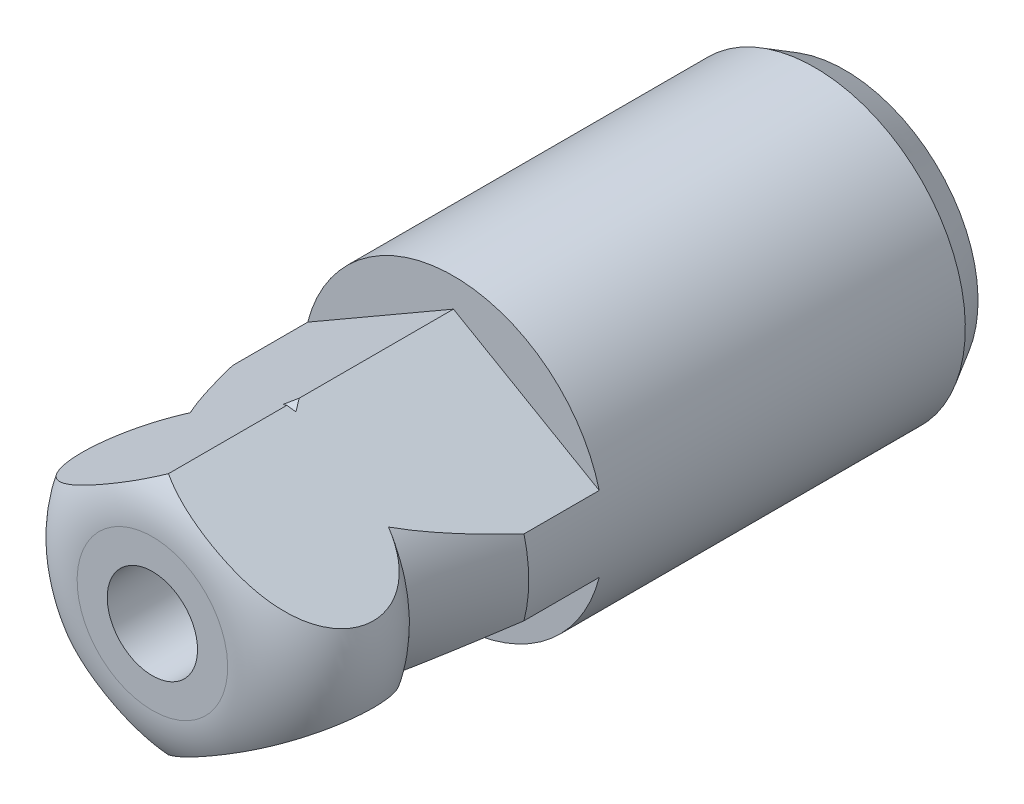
ISO-10303-21;
HEADER;
FILE_DESCRIPTION(('STEP AP214'),'2;1');
FILE_NAME('part.step','',(''),(''),'','','');
FILE_SCHEMA(('AUTOMOTIVE_DESIGN { 1 0 10303 214 1 1 1 1 }'));
ENDSEC;
DATA;
#1=APPLICATION_CONTEXT('core data for automotive mechanical design processes');
#2=APPLICATION_PROTOCOL_DEFINITION('international standard','automotive_design',2000,#1);
#3=PRODUCT_CONTEXT('',#1,'mechanical');
#4=PRODUCT('Part','Part','',(#3));
#5=PRODUCT_RELATED_PRODUCT_CATEGORY('part','',(#4));
#6=PRODUCT_DEFINITION_FORMATION('','',#4);
#7=PRODUCT_DEFINITION_CONTEXT('part definition',#1,'design');
#8=PRODUCT_DEFINITION('design','',#6,#7);
#9=PRODUCT_DEFINITION_SHAPE('','',#8);
#10=(LENGTH_UNIT() NAMED_UNIT(*) SI_UNIT(.MILLI.,.METRE.));
#11=(NAMED_UNIT(*) PLANE_ANGLE_UNIT() SI_UNIT($,.RADIAN.));
#12=(NAMED_UNIT(*) SI_UNIT($,.STERADIAN.) SOLID_ANGLE_UNIT());
#13=UNCERTAINTY_MEASURE_WITH_UNIT(LENGTH_MEASURE(1.E-05),#10,'distance_accuracy_value','');
#14=(GEOMETRIC_REPRESENTATION_CONTEXT(3) GLOBAL_UNCERTAINTY_ASSIGNED_CONTEXT((#13)) GLOBAL_UNIT_ASSIGNED_CONTEXT((#10,
#11,#12)) REPRESENTATION_CONTEXT('',''));
#15=CARTESIAN_POINT('',(0.,0.,0.));
#16=DIRECTION('',(0.,0.,1.));
#17=DIRECTION('',(1.,0.,0.));
#18=AXIS2_PLACEMENT_3D('',#15,#16,#17);
#19=CARTESIAN_POINT('',(0.,0.,0.));
#20=DIRECTION('',(0.,0.,-1.));
#21=DIRECTION('',(0.,-1.,0.));
#22=AXIS2_PLACEMENT_3D('',#19,#20,#21);
#23=CYLINDRICAL_SURFACE('',#22,5.);
#24=DIRECTION('',(0.,0.,1.));
#25=VECTOR('',#24,1.);
#26=CARTESIAN_POINT('',(4.841229,-1.25,13.));
#27=LINE('',#26,#25);
#28=CARTESIAN_POINT('',(4.841229,-1.25,13.));
#29=VERTEX_POINT('',#28);
#30=CARTESIAN_POINT('',(4.841229,-1.25,15.5000004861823));
#31=VERTEX_POINT('',#30);
#32=EDGE_CURVE('E126',#29,#31,#27,.T.);
#33=ORIENTED_EDGE('',*,*,#32,.F.);
#34=CARTESIAN_POINT('',(0.,0.,13.));
#35=DIRECTION('',(0.,0.,1.));
#36=DIRECTION('',(0.,1.,0.));
#37=AXIS2_PLACEMENT_3D('',#34,#35,#36);
#38=CIRCLE('',#37,5.);
#39=CARTESIAN_POINT('',(-4.841229,-1.25,13.));
#40=VERTEX_POINT('',#39);
#41=EDGE_CURVE('E18',#40,#29,#38,.T.);
#42=ORIENTED_EDGE('',*,*,#41,.F.);
#43=DIRECTION('',(0.,0.,1.));
#44=VECTOR('',#43,1.);
#45=CARTESIAN_POINT('',(-4.841229,-1.25,13.));
#46=LINE('',#45,#44);
#47=CARTESIAN_POINT('',(-4.841229,-1.25,15.5000004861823));
#48=VERTEX_POINT('',#47);
#49=EDGE_CURVE('E103',#40,#48,#46,.T.);
#50=ORIENTED_EDGE('',*,*,#49,.T.);
#51=CARTESIAN_POINT('',(0.,0.,15.5));
#52=DIRECTION('',(0.,0.,-1.));
#53=DIRECTION('',(0.,-1.,0.));
#54=AXIS2_PLACEMENT_3D('',#51,#52,#53);
#55=CIRCLE('',#54,5.);
#56=CARTESIAN_POINT('',(-4.841229,1.25,15.5000004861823));
#57=VERTEX_POINT('',#56);
#58=EDGE_CURVE('E262',#48,#57,#55,.T.);
#59=ORIENTED_EDGE('',*,*,#58,.T.);
#60=DIRECTION('',(0.,0.,1.));
#61=VECTOR('',#60,1.);
#62=CARTESIAN_POINT('',(-4.841229,1.25,13.));
#63=LINE('',#62,#61);
#64=CARTESIAN_POINT('',(-4.841229,1.25,13.));
#65=VERTEX_POINT('',#64);
#66=EDGE_CURVE('E286',#65,#57,#63,.T.);
#67=ORIENTED_EDGE('',*,*,#66,.F.);
#68=CARTESIAN_POINT('',(4.841229,1.25,13.));
#69=VERTEX_POINT('',#68);
#70=EDGE_CURVE('E9',#69,#65,#38,.T.);
#71=ORIENTED_EDGE('',*,*,#70,.F.);
#72=DIRECTION('',(0.,0.,1.));
#73=VECTOR('',#72,1.);
#74=CARTESIAN_POINT('',(4.841229,1.25,13.));
#75=LINE('',#74,#73);
#76=CARTESIAN_POINT('',(4.841229,1.25,15.5000004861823));
#77=VERTEX_POINT('',#76);
#78=EDGE_CURVE('E250',#69,#77,#75,.T.);
#79=ORIENTED_EDGE('',*,*,#78,.T.);
#80=EDGE_CURVE('E257',#77,#31,#55,.T.);
#81=ORIENTED_EDGE('',*,*,#80,.T.);
#82=EDGE_LOOP('',(#33,#42,#50,#59,#67,#71,#79,#81));
#83=FACE_BOUND('',#82,.T.);
#84=CARTESIAN_POINT('',(0.,0.,1.));
#85=DIRECTION('',(0.,0.,-1.));
#86=DIRECTION('',(0.,-1.,0.));
#87=AXIS2_PLACEMENT_3D('',#84,#85,#86);
#88=CIRCLE('',#87,5.);
#89=CARTESIAN_POINT('',(0.,-5.,1.));
#90=VERTEX_POINT('',#89);
#91=EDGE_CURVE('E264',#90,#90,#88,.T.);
#92=ORIENTED_EDGE('',*,*,#91,.F.);
#93=EDGE_LOOP('',(#92));
#94=FACE_BOUND('',#93,.T.);
#95=ADVANCED_FACE('F14',(#83,#94),#23,.T.);
#96=CARTESIAN_POINT('',(0.,0.,18.4474318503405));
#97=DIRECTION('',(0.,0.,-1.));
#98=DIRECTION('',(0.,-1.,0.));
#99=AXIS2_PLACEMENT_3D('',#96,#97,#98);
#100=CONICAL_SURFACE('',#99,3.92722247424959,0.349065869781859);
#101=CARTESIAN_POINT('',(-6.36956118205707,0.367616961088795,11.7080395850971));
#102=CARTESIAN_POINT('',(-6.30104796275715,0.407173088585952,11.8896948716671));
#103=CARTESIAN_POINT('',(-6.23215403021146,0.446949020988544,12.0711590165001));
#104=CARTESIAN_POINT('',(-6.09348453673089,0.527009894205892,12.4336418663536));
#105=CARTESIAN_POINT('',(-6.02370895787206,0.567294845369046,12.6146605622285));
#106=CARTESIAN_POINT('',(-5.81281108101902,0.68905679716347,13.1571293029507));
#107=CARTESIAN_POINT('',(-5.67018814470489,0.771400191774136,13.5178042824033));
#108=CARTESIAN_POINT('',(-5.37957492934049,0.93918581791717,14.2363675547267));
#109=CARTESIAN_POINT('',(-5.23158359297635,1.02462865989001,14.5942552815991));
#110=CARTESIAN_POINT('',(-5.00398625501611,1.15603205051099,15.1278547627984));
#111=CARTESIAN_POINT('',(-4.92719306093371,1.20036862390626,15.3051657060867));
#112=CARTESIAN_POINT('',(-4.77132994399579,1.29035624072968,15.6584462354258));
#113=CARTESIAN_POINT('',(-4.69226009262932,1.3360072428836,15.8344158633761));
#114=CARTESIAN_POINT('',(-4.55274608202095,1.41655569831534,16.1380347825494));
#115=CARTESIAN_POINT('',(-4.49294621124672,1.45108117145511,16.2660785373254));
#116=CARTESIAN_POINT('',(-4.37157183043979,1.52115670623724,16.5210484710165));
#117=CARTESIAN_POINT('',(-4.30999725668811,1.55670680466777,16.6479746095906));
#118=CARTESIAN_POINT('',(-4.18466508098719,1.62906737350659,16.900584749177));
#119=CARTESIAN_POINT('',(-4.12090498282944,1.66587928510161,17.0262671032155));
#120=CARTESIAN_POINT('',(-3.9908364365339,1.74097439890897,17.275857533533));
#121=CARTESIAN_POINT('',(-3.92452815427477,1.77925750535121,17.399765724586));
#122=CARTESIAN_POINT('',(-3.79460267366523,1.85427002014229,17.6347467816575));
#123=CARTESIAN_POINT('',(-3.73124280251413,1.89085086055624,17.7460086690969));
#124=CARTESIAN_POINT('',(-3.60131772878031,1.96586314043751,17.9660040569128));
#125=CARTESIAN_POINT('',(-3.53475291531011,2.00429435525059,18.0747378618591));
#126=CARTESIAN_POINT('',(-3.39771537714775,2.08341301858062,18.2886510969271));
#127=CARTESIAN_POINT('',(-3.32724846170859,2.12409711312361,18.3938354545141));
#128=CARTESIAN_POINT('',(-3.18127224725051,2.20837652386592,18.5993948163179));
#129=CARTESIAN_POINT('',(-3.10576586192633,2.25197015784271,18.6997725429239));
#130=CARTESIAN_POINT('',(-2.95421100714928,2.33947039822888,18.886111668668));
#131=CARTESIAN_POINT('',(-2.8786435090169,2.38309931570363,18.9725886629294));
#132=CARTESIAN_POINT('',(-2.72030579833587,2.47451563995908,19.1366013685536));
#133=CARTESIAN_POINT('',(-2.63753301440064,2.52230453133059,19.2141338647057));
#134=CARTESIAN_POINT('',(-2.4794753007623,2.61355919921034,19.3418008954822));
#135=CARTESIAN_POINT('',(-2.40568046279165,2.65616467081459,19.3943478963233));
#136=CARTESIAN_POINT('',(-2.25188492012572,2.74495857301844,19.4854894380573));
#137=CARTESIAN_POINT('',(-2.17190282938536,2.79113625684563,19.5241239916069));
#138=CARTESIAN_POINT('',(-2.0275964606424,2.87445158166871,19.5747763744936));
#139=CARTESIAN_POINT('',(-1.96441157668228,2.91093139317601,19.5910498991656));
#140=CARTESIAN_POINT('',(-1.83655467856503,2.98474961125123,19.6109189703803));
#141=CARTESIAN_POINT('',(-1.77188385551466,3.0220873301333,19.6145243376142));
#142=CARTESIAN_POINT('',(-1.6429934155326,3.09650226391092,19.6085816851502));
#143=CARTESIAN_POINT('',(-1.57877394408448,3.13357939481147,19.599029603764));
#144=CARTESIAN_POINT('',(-1.45256574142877,3.20644573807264,19.5680063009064));
#145=CARTESIAN_POINT('',(-1.39057866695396,3.2422339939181,19.5465264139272));
#146=CARTESIAN_POINT('',(-1.2409554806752,3.32861898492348,19.4812340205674));
#147=CARTESIAN_POINT('',(-1.15523531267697,3.37810954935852,19.431653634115));
#148=CARTESIAN_POINT('',(-0.991204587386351,3.47281273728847,19.3181570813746));
#149=CARTESIAN_POINT('',(-0.912921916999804,3.51800926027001,19.2541897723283));
#150=CARTESIAN_POINT('',(-0.739365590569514,3.6182120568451,19.0954248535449));
#151=CARTESIAN_POINT('',(-0.646452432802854,3.67185549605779,18.9972468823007));
#152=CARTESIAN_POINT('',(-0.469031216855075,3.77428968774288,18.7911233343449));
#153=CARTESIAN_POINT('',(-0.38454166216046,3.82306975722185,18.6831572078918));
#154=CARTESIAN_POINT('',(-0.220990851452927,3.91749586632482,18.4596129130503));
#155=CARTESIAN_POINT('',(-0.142010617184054,3.96309512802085,18.343956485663));
#156=CARTESIAN_POINT('',(-0.0273868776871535,4.02927317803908,18.1672955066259));
#157=CARTESIAN_POINT('',(0.0101617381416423,4.05095188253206,18.1079102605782));
#158=CARTESIAN_POINT('',(0.0841397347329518,4.09366310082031,17.9882179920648));
#159=CARTESIAN_POINT('',(0.120569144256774,4.11469563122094,17.927910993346));
#160=CARTESIAN_POINT('',(0.230716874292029,4.17828945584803,17.7418751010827));
#161=CARTESIAN_POINT('',(0.302826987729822,4.21992225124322,17.6148763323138));
#162=CARTESIAN_POINT('',(0.443724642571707,4.30126955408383,17.3584361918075));
#163=CARTESIAN_POINT('',(0.512511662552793,4.34098376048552,17.2289944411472));
#164=CARTESIAN_POINT('',(0.647421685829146,4.41887410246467,16.9681892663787));
#165=CARTESIAN_POINT('',(0.713543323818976,4.45704944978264,16.8368249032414));
#166=CARTESIAN_POINT('',(0.843561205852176,4.53211531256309,16.5726330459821));
#167=CARTESIAN_POINT('',(0.907457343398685,4.56900576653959,16.4398054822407));
#168=CARTESIAN_POINT('',(1.09674619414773,4.67829174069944,16.0387912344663));
#169=CARTESIAN_POINT('',(1.2193456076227,4.74907454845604,15.7688470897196));
#170=CARTESIAN_POINT('',(1.45913823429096,4.88751889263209,15.2259045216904));
#171=CARTESIAN_POINT('',(1.57633302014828,4.95518133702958,14.9529070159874));
#172=CARTESIAN_POINT('',(1.79468425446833,5.0812464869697,14.4331578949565));
#173=CARTESIAN_POINT('',(1.89624100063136,5.13988030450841,14.1866298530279));
#174=CARTESIAN_POINT('',(2.09676435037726,5.25565251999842,13.6921498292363));
#175=CARTESIAN_POINT('',(2.19573072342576,5.31279078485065,13.4441977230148));
#176=CARTESIAN_POINT('',(2.39096417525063,5.42550887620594,12.9486922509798));
#177=CARTESIAN_POINT('',(2.48724396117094,5.48109603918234,12.7011455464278));
#178=CARTESIAN_POINT('',(2.67805278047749,5.59125956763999,12.2051944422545));
#179=CARTESIAN_POINT('',(2.77258205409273,5.64583607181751,11.9567901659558));
#180=CARTESIAN_POINT('',(2.86641472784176,5.70001039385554,11.7080395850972));
#181=B_SPLINE_CURVE_WITH_KNOTS('',3,(#101,#102,#103,#104,#105,#106,#107,#108,#109,#110,#111,
#112,#113,#114,#115,#116,#117,#118,#119,#120,#121,#122,#123,#124,#125,#126,#127,#128,#129,#130,
#131,#132,#133,#134,#135,#136,#137,#138,#139,#140,#141,#142,#143,#144,#145,#146,#147,#148,#149,
#150,#151,#152,#153,#154,#155,#156,#157,#158,#159,#160,#161,#162,#163,#164,#165,#166,#167,#168,
#169,#170,#171,#172,#173,#174,#175,#176,#177,#178,#179,#180),.UNSPECIFIED.,.F.,.F.,(4,2,2,2,2,2,
2,2,2,2,2,2,2,2,2,2,2,2,2,2,2,2,2,2,2,2,2,2,2,2,2,2,2,2,2,2,2,2,2,4),(0.,0.594403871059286,
1.18881984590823,2.37826558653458,3.56794687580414,4.16267335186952,4.75738117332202,
5.1937938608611,5.63022223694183,6.06716687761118,6.50408312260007,6.90350770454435,
7.30288391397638,7.70168075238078,8.10024898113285,8.46840528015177,8.83669350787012,
9.13617717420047,9.4347925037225,9.65808439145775,9.8812031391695,10.1043907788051,
10.3277407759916,10.6579392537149,10.989330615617,11.4245447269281,11.8606946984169,
12.3022946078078,12.5228693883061,12.7434384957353,13.198923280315,13.6544793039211,
14.1102657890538,14.5660740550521,15.480382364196,16.3944229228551,17.2133911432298,
18.0324320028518,18.8465183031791,19.6604920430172),.UNSPECIFIED.);
#182=CARTESIAN_POINT('',(-3.28887006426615,2.1462548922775,18.4474318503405));
#183=VERTEX_POINT('',#182);
#184=EDGE_CURVE('E165',#57,#183,#181,.T.);
#185=ORIENTED_EDGE('',*,*,#184,.F.);
#186=ORIENTED_EDGE('',*,*,#58,.F.);
#187=CARTESIAN_POINT('',(2.8664147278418,-5.70001039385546,11.7080395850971));
#188=CARTESIAN_POINT('',(2.79790150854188,-5.6604542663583,11.889694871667));
#189=CARTESIAN_POINT('',(2.72900757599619,-5.62067833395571,12.0711590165));
#190=CARTESIAN_POINT('',(2.59033808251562,-5.54061746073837,12.4336418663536));
#191=CARTESIAN_POINT('',(2.52056250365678,-5.50033250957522,12.6146605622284));
#192=CARTESIAN_POINT('',(2.30966462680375,-5.37857055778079,13.1571293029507));
#193=CARTESIAN_POINT('',(2.16704169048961,-5.29622716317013,13.5178042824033));
#194=CARTESIAN_POINT('',(1.87642847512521,-5.1284415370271,14.2363675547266));
#195=CARTESIAN_POINT('',(1.72843713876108,-5.04299869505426,14.5942552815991));
#196=CARTESIAN_POINT('',(1.50083980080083,-4.91159530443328,15.1278547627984));
#197=CARTESIAN_POINT('',(1.42404660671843,-4.867258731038,15.3051657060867));
#198=CARTESIAN_POINT('',(1.26818348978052,-4.77727111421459,15.6584462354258));
#199=CARTESIAN_POINT('',(1.18911363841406,-4.73162011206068,15.8344158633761));
#200=CARTESIAN_POINT('',(1.04959962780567,-4.65107165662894,16.1380347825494));
#201=CARTESIAN_POINT('',(0.989799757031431,-4.61654618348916,16.2660785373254));
#202=CARTESIAN_POINT('',(0.868425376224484,-4.54647064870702,16.5210484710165));
#203=CARTESIAN_POINT('',(0.806850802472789,-4.51092055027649,16.6479746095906));
#204=CARTESIAN_POINT('',(0.681518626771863,-4.43855998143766,16.9005847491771));
#205=CARTESIAN_POINT('',(0.617758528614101,-4.40174806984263,17.0262671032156));
#206=CARTESIAN_POINT('',(0.48768998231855,-4.32665295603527,17.2758575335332));
#207=CARTESIAN_POINT('',(0.421381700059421,-4.28836984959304,17.3997657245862));
#208=CARTESIAN_POINT('',(0.291456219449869,-4.21335733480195,17.6347467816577));
#209=CARTESIAN_POINT('',(0.228096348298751,-4.17677649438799,17.7460086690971));
#210=CARTESIAN_POINT('',(0.098171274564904,-4.10176421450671,17.966004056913));
#211=CARTESIAN_POINT('',(0.0316064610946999,-4.06333299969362,18.0747378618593));
#212=CARTESIAN_POINT('',(-0.105431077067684,-3.98421433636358,18.2886510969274));
#213=CARTESIAN_POINT('',(-0.175897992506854,-3.94353024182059,18.3938354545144));
#214=CARTESIAN_POINT('',(-0.321874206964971,-3.85925083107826,18.5993948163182));
#215=CARTESIAN_POINT('',(-0.397380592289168,-3.81565719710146,18.6997725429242));
#216=CARTESIAN_POINT('',(-0.548935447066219,-3.72815695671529,18.8861116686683));
#217=CARTESIAN_POINT('',(-0.624502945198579,-3.68452803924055,18.9725886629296));
#218=CARTESIAN_POINT('',(-0.782840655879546,-3.59311171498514,19.1366013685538));
#219=CARTESIAN_POINT('',(-0.865613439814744,-3.54532282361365,19.2141338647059));
#220=CARTESIAN_POINT('',(-1.02367115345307,-3.45406815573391,19.3418008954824));
#221=CARTESIAN_POINT('',(-1.09746599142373,-3.41146268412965,19.3943478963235));
#222=CARTESIAN_POINT('',(-1.25126153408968,-3.32266878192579,19.4854894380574));
#223=CARTESIAN_POINT('',(-1.33124362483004,-3.27649109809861,19.5241239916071));
#224=CARTESIAN_POINT('',(-1.475549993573,-3.19317577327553,19.5747763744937));
#225=CARTESIAN_POINT('',(-1.53873487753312,-3.15669596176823,19.5910498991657));
#226=CARTESIAN_POINT('',(-1.66659177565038,-3.08287774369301,19.6109189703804));
#227=CARTESIAN_POINT('',(-1.73126259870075,-3.04554002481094,19.6145243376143));
#228=CARTESIAN_POINT('',(-1.8601530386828,-2.97112509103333,19.6085816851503));
#229=CARTESIAN_POINT('',(-1.92437251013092,-2.93404796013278,19.5990296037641));
#230=CARTESIAN_POINT('',(-2.05058071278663,-2.86118161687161,19.5680063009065));
#231=CARTESIAN_POINT('',(-2.11256778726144,-2.82539336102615,19.5465264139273));
#232=CARTESIAN_POINT('',(-2.2621909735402,-2.73900837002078,19.4812340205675));
#233=CARTESIAN_POINT('',(-2.34791114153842,-2.68951780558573,19.4316536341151));
#234=CARTESIAN_POINT('',(-2.51194186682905,-2.59481461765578,19.3181570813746));
#235=CARTESIAN_POINT('',(-2.59022453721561,-2.54961809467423,19.2541897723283));
#236=CARTESIAN_POINT('',(-2.76378086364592,-2.44941529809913,19.0954248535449));
#237=CARTESIAN_POINT('',(-2.85669402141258,-2.39577185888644,18.9972468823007));
#238=CARTESIAN_POINT('',(-3.03411523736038,-2.29333766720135,18.7911233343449));
#239=CARTESIAN_POINT('',(-3.11860479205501,-2.24455759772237,18.6831572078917));
#240=CARTESIAN_POINT('',(-3.28215560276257,-2.15013148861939,18.4596129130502));
#241=CARTESIAN_POINT('',(-3.36113583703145,-2.10453222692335,18.3439564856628));
#242=CARTESIAN_POINT('',(-3.47575957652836,-2.03835417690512,18.1672955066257));
#243=CARTESIAN_POINT('',(-3.51330819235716,-2.01667547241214,18.107910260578));
#244=CARTESIAN_POINT('',(-3.58728618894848,-1.97396425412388,17.9882179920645));
#245=CARTESIAN_POINT('',(-3.6237155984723,-1.95293172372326,17.9279109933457));
#246=CARTESIAN_POINT('',(-3.73386332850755,-1.88933789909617,17.7418751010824));
#247=CARTESIAN_POINT('',(-3.80597344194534,-1.84770510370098,17.6148763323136));
#248=CARTESIAN_POINT('',(-3.94687109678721,-1.76635780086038,17.3584361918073));
#249=CARTESIAN_POINT('',(-4.01565811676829,-1.7266435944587,17.228994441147));
#250=CARTESIAN_POINT('',(-4.15056814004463,-1.64875325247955,16.9681892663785));
#251=CARTESIAN_POINT('',(-4.21668977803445,-1.61057790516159,16.8368249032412));
#252=CARTESIAN_POINT('',(-4.34670766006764,-1.53551204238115,16.5726330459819));
#253=CARTESIAN_POINT('',(-4.41060379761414,-1.49862158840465,16.4398054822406));
#254=CARTESIAN_POINT('',(-4.59989264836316,-1.38933561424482,16.0387912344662));
#255=CARTESIAN_POINT('',(-4.72249206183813,-1.31855280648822,15.7688470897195));
#256=CARTESIAN_POINT('',(-4.96228468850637,-1.18010846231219,15.2259045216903));
#257=CARTESIAN_POINT('',(-5.07947947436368,-1.11244601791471,14.9529070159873));
#258=CARTESIAN_POINT('',(-5.29783070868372,-0.986380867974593,14.4331578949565));
#259=CARTESIAN_POINT('',(-5.39938745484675,-0.927747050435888,14.1866298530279));
#260=CARTESIAN_POINT('',(-5.59991080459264,-0.811974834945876,13.6921498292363));
#261=CARTESIAN_POINT('',(-5.69887717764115,-0.754836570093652,13.4441977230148));
#262=CARTESIAN_POINT('',(-5.89411062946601,-0.642118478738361,12.9486922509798));
#263=CARTESIAN_POINT('',(-5.99039041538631,-0.586531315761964,12.7011455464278));
#264=CARTESIAN_POINT('',(-6.18119923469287,-0.476367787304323,12.2051944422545));
#265=CARTESIAN_POINT('',(-6.27572850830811,-0.421791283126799,11.9567901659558));
#266=CARTESIAN_POINT('',(-6.36956118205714,-0.367616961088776,11.7080395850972));
#267=B_SPLINE_CURVE_WITH_KNOTS('',3,(#187,#188,#189,#190,#191,#192,#193,#194,#195,#196,#197,
#198,#199,#200,#201,#202,#203,#204,#205,#206,#207,#208,#209,#210,#211,#212,#213,#214,#215,#216,
#217,#218,#219,#220,#221,#222,#223,#224,#225,#226,#227,#228,#229,#230,#231,#232,#233,#234,#235,
#236,#237,#238,#239,#240,#241,#242,#243,#244,#245,#246,#247,#248,#249,#250,#251,#252,#253,#254,
#255,#256,#257,#258,#259,#260,#261,#262,#263,#264,#265,#266),.UNSPECIFIED.,.F.,.F.,(4,2,2,2,2,2,
2,2,2,2,2,2,2,2,2,2,2,2,2,2,2,2,2,2,2,2,2,2,2,2,2,2,2,2,2,2,2,2,2,4),(0.,0.594403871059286,
1.18881984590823,2.37826558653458,3.56794687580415,4.16267335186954,4.75738117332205,
5.19379386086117,5.63022223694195,6.06716687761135,6.50408312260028,6.90350770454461,
7.30288391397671,7.70168075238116,8.10024898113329,8.46840528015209,8.83669350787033,
9.13617717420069,9.43479250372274,9.65808439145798,9.88120313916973,10.1043907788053,
10.3277407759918,10.6579392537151,10.9893306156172,11.4245447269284,11.8606946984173,
12.3022946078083,12.5228693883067,12.7434384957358,13.1989232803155,13.6544793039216,
14.1102657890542,14.5660740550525,15.4803823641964,16.3944229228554,17.2133911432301,
18.032432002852,18.8465183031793,19.6604920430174),.UNSPECIFIED.);
#268=CARTESIAN_POINT('',(-3.28887006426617,-2.14625489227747,18.4474318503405));
#269=VERTEX_POINT('',#268);
#270=EDGE_CURVE('E108',#269,#48,#267,.T.);
#271=ORIENTED_EDGE('',*,*,#270,.F.);
#272=CARTESIAN_POINT('',(0.,0.,18.4474318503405));
#273=DIRECTION('',(0.,0.,-1.));
#274=DIRECTION('',(0.,-1.,0.));
#275=AXIS2_PLACEMENT_3D('',#272,#273,#274);
#276=CIRCLE('',#275,3.92722247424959);
#277=EDGE_CURVE('E254',#269,#183,#276,.T.);
#278=ORIENTED_EDGE('',*,*,#277,.T.);
#279=EDGE_LOOP('',(#185,#186,#271,#278));
#280=FACE_BOUND('',#279,.T.);
#281=ADVANCED_FACE('F181',(#280),#100,.T.);
#282=CARTESIAN_POINT('',(-2.86641472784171,5.70001039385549,11.7080395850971));
#283=CARTESIAN_POINT('',(-2.79790150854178,5.66045426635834,11.8896948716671));
#284=CARTESIAN_POINT('',(-2.72900757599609,5.62067833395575,12.0711590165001));
#285=CARTESIAN_POINT('',(-2.59033808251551,5.5406174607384,12.4336418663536));
#286=CARTESIAN_POINT('',(-2.52056250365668,5.50033250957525,12.6146605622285));
#287=CARTESIAN_POINT('',(-2.30966462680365,5.37857055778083,13.1571293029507));
#288=CARTESIAN_POINT('',(-2.16704169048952,5.29622716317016,13.5178042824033));
#289=CARTESIAN_POINT('',(-1.87642847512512,5.12844153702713,14.2363675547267));
#290=CARTESIAN_POINT('',(-1.72843713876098,5.04299869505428,14.5942552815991));
#291=CARTESIAN_POINT('',(-1.50083980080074,4.9115953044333,15.1278547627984));
#292=CARTESIAN_POINT('',(-1.42404660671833,4.86725873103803,15.3051657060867));
#293=CARTESIAN_POINT('',(-1.26818348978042,4.77727111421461,15.6584462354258));
#294=CARTESIAN_POINT('',(-1.18911363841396,4.73162011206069,15.8344158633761));
#295=CARTESIAN_POINT('',(-1.04959962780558,4.65107165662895,16.1380347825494));
#296=CARTESIAN_POINT('',(-0.989799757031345,4.61654618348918,16.2660785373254));
#297=CARTESIAN_POINT('',(-0.868425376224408,4.54647064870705,16.5210484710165));
#298=CARTESIAN_POINT('',(-0.806850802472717,4.51092055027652,16.6479746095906));
#299=CARTESIAN_POINT('',(-0.681518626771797,4.4385599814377,16.900584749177));
#300=CARTESIAN_POINT('',(-0.617758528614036,4.40174806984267,17.0262671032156));
#301=CARTESIAN_POINT('',(-0.4876899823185,4.32665295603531,17.2758575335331));
#302=CARTESIAN_POINT('',(-0.421381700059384,4.28836984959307,17.3997657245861));
#303=CARTESIAN_POINT('',(-0.291456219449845,4.21335733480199,17.6347467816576));
#304=CARTESIAN_POINT('',(-0.228096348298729,4.17677649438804,17.746008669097));
#305=CARTESIAN_POINT('',(-0.0981712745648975,4.10176421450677,17.9660040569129));
#306=CARTESIAN_POINT('',(-0.0316064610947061,4.06333299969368,18.0747378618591));
#307=CARTESIAN_POINT('',(0.105431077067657,3.98421433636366,18.2886510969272));
#308=CARTESIAN_POINT('',(0.175897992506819,3.94353024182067,18.3938354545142));
#309=CARTESIAN_POINT('',(0.321874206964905,3.85925083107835,18.599394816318));
#310=CARTESIAN_POINT('',(0.39738059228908,3.81565719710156,18.699772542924));
#311=CARTESIAN_POINT('',(0.548935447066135,3.72815695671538,18.8861116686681));
#312=CARTESIAN_POINT('',(0.624502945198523,3.68452803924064,18.9725886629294));
#313=CARTESIAN_POINT('',(0.782840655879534,3.5931117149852,19.1366013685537));
#314=CARTESIAN_POINT('',(0.865613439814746,3.54532282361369,19.2141338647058));
#315=CARTESIAN_POINT('',(1.02367115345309,3.45406815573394,19.3418008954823));
#316=CARTESIAN_POINT('',(1.09746599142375,3.41146268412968,19.3943478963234));
#317=CARTESIAN_POINT('',(1.25126153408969,3.32266878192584,19.4854894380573));
#318=CARTESIAN_POINT('',(1.33124362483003,3.27649109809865,19.524123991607));
#319=CARTESIAN_POINT('',(1.47554999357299,3.19317577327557,19.5747763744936));
#320=CARTESIAN_POINT('',(1.53873487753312,3.15669596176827,19.5910498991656));
#321=CARTESIAN_POINT('',(1.66659177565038,3.08287774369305,19.6109189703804));
#322=CARTESIAN_POINT('',(1.73126259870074,3.04554002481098,19.6145243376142));
#323=CARTESIAN_POINT('',(1.86015303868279,2.97112509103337,19.6085816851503));
#324=CARTESIAN_POINT('',(1.92437251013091,2.93404796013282,19.5990296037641));
#325=CARTESIAN_POINT('',(2.05058071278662,2.86118161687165,19.5680063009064));
#326=CARTESIAN_POINT('',(2.11256778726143,2.82539336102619,19.5465264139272));
#327=CARTESIAN_POINT('',(2.2621909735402,2.73900837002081,19.4812340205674));
#328=CARTESIAN_POINT('',(2.34791114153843,2.68951780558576,19.431653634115));
#329=CARTESIAN_POINT('',(2.51194186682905,2.59481461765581,19.3181570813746));
#330=CARTESIAN_POINT('',(2.59022453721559,2.54961809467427,19.2541897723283));
#331=CARTESIAN_POINT('',(2.76378086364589,2.44941529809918,19.0954248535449));
#332=CARTESIAN_POINT('',(2.85669402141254,2.39577185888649,18.9972468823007));
#333=CARTESIAN_POINT('',(3.03411523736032,2.29333766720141,18.7911233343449));
#334=CARTESIAN_POINT('',(3.11860479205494,2.24455759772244,18.6831572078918));
#335=CARTESIAN_POINT('',(3.28215560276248,2.15013148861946,18.4596129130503));
#336=CARTESIAN_POINT('',(3.36113583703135,2.10453222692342,18.343956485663));
#337=CARTESIAN_POINT('',(3.47575957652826,2.0383541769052,18.1672955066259));
#338=CARTESIAN_POINT('',(3.51330819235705,2.01667547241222,18.1079102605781));
#339=CARTESIAN_POINT('',(3.58728618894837,1.97396425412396,17.9882179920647));
#340=CARTESIAN_POINT('',(3.62371559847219,1.95293172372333,17.9279109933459));
#341=CARTESIAN_POINT('',(3.73386332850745,1.88933789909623,17.7418751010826));
#342=CARTESIAN_POINT('',(3.80597344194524,1.84770510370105,17.6148763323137));
#343=CARTESIAN_POINT('',(3.94687109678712,1.76635780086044,17.3584361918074));
#344=CARTESIAN_POINT('',(4.01565811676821,1.72664359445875,17.2289944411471));
#345=CARTESIAN_POINT('',(4.15056814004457,1.64875325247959,16.9681892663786));
#346=CARTESIAN_POINT('',(4.2166897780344,1.61057790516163,16.8368249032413));
#347=CARTESIAN_POINT('',(4.3467076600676,1.53551204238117,16.572633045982));
#348=CARTESIAN_POINT('',(4.41060379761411,1.49862158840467,16.4398054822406));
#349=CARTESIAN_POINT('',(4.59989264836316,1.38933561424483,16.0387912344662));
#350=CARTESIAN_POINT('',(4.72249206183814,1.31855280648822,15.7688470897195));
#351=CARTESIAN_POINT('',(4.9622846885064,1.18010846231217,15.2259045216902));
#352=CARTESIAN_POINT('',(5.07947947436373,1.11244601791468,14.9529070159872));
#353=CARTESIAN_POINT('',(5.29783070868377,0.986380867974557,14.4331578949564));
#354=CARTESIAN_POINT('',(5.3993874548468,0.927747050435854,14.1866298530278));
#355=CARTESIAN_POINT('',(5.59991080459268,0.811974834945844,13.6921498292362));
#356=CARTESIAN_POINT('',(5.69887717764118,0.754836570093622,13.4441977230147));
#357=CARTESIAN_POINT('',(5.89411062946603,0.642118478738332,12.9486922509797));
#358=CARTESIAN_POINT('',(5.99039041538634,0.586531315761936,12.7011455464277));
#359=CARTESIAN_POINT('',(6.18119923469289,0.476367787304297,12.2051944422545));
#360=CARTESIAN_POINT('',(6.27572850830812,0.421791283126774,11.9567901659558));
#361=CARTESIAN_POINT('',(6.36956118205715,0.367616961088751,11.7080395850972));
#362=B_SPLINE_CURVE_WITH_KNOTS('',3,(#282,#283,#284,#285,#286,#287,#288,#289,#290,#291,#292,
#293,#294,#295,#296,#297,#298,#299,#300,#301,#302,#303,#304,#305,#306,#307,#308,#309,#310,#311,
#312,#313,#314,#315,#316,#317,#318,#319,#320,#321,#322,#323,#324,#325,#326,#327,#328,#329,#330,
#331,#332,#333,#334,#335,#336,#337,#338,#339,#340,#341,#342,#343,#344,#345,#346,#347,#348,#349,
#350,#351,#352,#353,#354,#355,#356,#357,#358,#359,#360,#361),.UNSPECIFIED.,.F.,.F.,(4,2,2,2,2,2,
2,2,2,2,2,2,2,2,2,2,2,2,2,2,2,2,2,2,2,2,2,2,2,2,2,2,2,2,2,2,2,2,2,4),(0.,0.594403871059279,
1.18881984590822,2.37826558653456,3.56794687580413,4.16267335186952,4.75738117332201,
5.1937938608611,5.63022223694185,6.06716687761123,6.50408312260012,6.9035077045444,
7.30288391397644,7.70168075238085,8.10024898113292,8.46840528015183,8.83669350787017,
9.13617717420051,9.43479250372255,9.6580843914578,9.88120313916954,10.1043907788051,
10.3277407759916,10.657939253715,10.989330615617,11.4245447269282,11.860694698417,
12.3022946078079,12.5228693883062,12.7434384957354,13.1989232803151,13.6544793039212,
14.1102657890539,14.5660740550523,15.4803823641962,16.3944229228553,17.21339114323,
18.0324320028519,18.8465183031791,19.6604920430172),.UNSPECIFIED.);
#363=CARTESIAN_POINT('',(3.28887006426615,2.1462548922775,18.4474318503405));
#364=VERTEX_POINT('',#363);
#365=EDGE_CURVE('E173',#364,#77,#362,.T.);
#366=ORIENTED_EDGE('',*,*,#365,.F.);
#367=CARTESIAN_POINT('',(3.28887006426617,-2.14625489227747,18.4474318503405));
#368=VERTEX_POINT('',#367);
#369=EDGE_CURVE('E255',#364,#368,#276,.T.);
#370=ORIENTED_EDGE('',*,*,#369,.T.);
#371=CARTESIAN_POINT('',(6.36956118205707,-0.367616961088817,11.7080395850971));
#372=CARTESIAN_POINT('',(6.30104796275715,-0.407173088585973,11.8896948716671));
#373=CARTESIAN_POINT('',(6.23215403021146,-0.446949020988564,12.0711590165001));
#374=CARTESIAN_POINT('',(6.09348453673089,-0.527009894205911,12.4336418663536));
#375=CARTESIAN_POINT('',(6.02370895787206,-0.567294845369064,12.6146605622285));
#376=CARTESIAN_POINT('',(5.81281108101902,-0.689056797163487,13.1571293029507));
#377=CARTESIAN_POINT('',(5.67018814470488,-0.771400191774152,13.5178042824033));
#378=CARTESIAN_POINT('',(5.37957492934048,-0.939185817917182,14.2363675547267));
#379=CARTESIAN_POINT('',(5.23158359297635,-1.02462865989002,14.5942552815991));
#380=CARTESIAN_POINT('',(5.0039862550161,-1.156032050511,15.1278547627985));
#381=CARTESIAN_POINT('',(4.92719306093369,-1.20036862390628,15.3051657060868));
#382=CARTESIAN_POINT('',(4.77132994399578,-1.29035624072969,15.6584462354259));
#383=CARTESIAN_POINT('',(4.69226009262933,-1.3360072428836,15.8344158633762));
#384=CARTESIAN_POINT('',(4.55274608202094,-1.41655569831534,16.1380347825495));
#385=CARTESIAN_POINT('',(4.4929462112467,-1.45108117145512,16.2660785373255));
#386=CARTESIAN_POINT('',(4.37157183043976,-1.52115670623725,16.5210484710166));
#387=CARTESIAN_POINT('',(4.30999725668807,-1.55670680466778,16.6479746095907));
#388=CARTESIAN_POINT('',(4.18466508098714,-1.62906737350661,16.9005847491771));
#389=CARTESIAN_POINT('',(4.12090498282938,-1.66587928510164,17.0262671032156));
#390=CARTESIAN_POINT('',(3.99083643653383,-1.740974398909,17.2758575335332));
#391=CARTESIAN_POINT('',(3.9245281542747,-1.77925750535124,17.3997657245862));
#392=CARTESIAN_POINT('',(3.79460267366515,-1.85427002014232,17.6347467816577));
#393=CARTESIAN_POINT('',(3.73124280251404,-1.89085086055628,17.7460086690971));
#394=CARTESIAN_POINT('',(3.6013177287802,-1.96586314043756,17.966004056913));
#395=CARTESIAN_POINT('',(3.53475291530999,-2.00429435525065,18.0747378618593));
#396=CARTESIAN_POINT('',(3.39771537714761,-2.08341301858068,18.2886510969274));
#397=CARTESIAN_POINT('',(3.32724846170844,-2.12409711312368,18.3938354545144));
#398=CARTESIAN_POINT('',(3.18127224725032,-2.208376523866,18.5993948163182));
#399=CARTESIAN_POINT('',(3.10576586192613,-2.2519701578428,18.6997725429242));
#400=CARTESIAN_POINT('',(2.95421100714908,-2.33947039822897,18.8861116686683));
#401=CARTESIAN_POINT('',(2.87864350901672,-2.38309931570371,18.9725886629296));
#402=CARTESIAN_POINT('',(2.72030579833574,-2.47451563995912,19.1366013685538));
#403=CARTESIAN_POINT('',(2.63753301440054,-2.52230453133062,19.2141338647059));
#404=CARTESIAN_POINT('',(2.47947530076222,-2.61355919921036,19.3418008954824));
#405=CARTESIAN_POINT('',(2.40568046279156,-2.65616467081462,19.3943478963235));
#406=CARTESIAN_POINT('',(2.25188492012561,-2.74495857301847,19.4854894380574));
#407=CARTESIAN_POINT('',(2.17190282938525,-2.79113625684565,19.5241239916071));
#408=CARTESIAN_POINT('',(2.02759646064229,-2.87445158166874,19.5747763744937));
#409=CARTESIAN_POINT('',(1.96441157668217,-2.91093139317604,19.5910498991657));
#410=CARTESIAN_POINT('',(1.83655467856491,-2.98474961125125,19.6109189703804));
#411=CARTESIAN_POINT('',(1.77188385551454,-3.02208733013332,19.6145243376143));
#412=CARTESIAN_POINT('',(1.64299341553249,-3.09650226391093,19.6085816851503));
#413=CARTESIAN_POINT('',(1.57877394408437,-3.13357939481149,19.5990296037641));
#414=CARTESIAN_POINT('',(1.45256574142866,-3.20644573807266,19.5680063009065));
#415=CARTESIAN_POINT('',(1.39057866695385,-3.24223399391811,19.5465264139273));
#416=CARTESIAN_POINT('',(1.24095548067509,-3.32861898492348,19.4812340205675));
#417=CARTESIAN_POINT('',(1.15523531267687,-3.37810954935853,19.4316536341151));
#418=CARTESIAN_POINT('',(0.991204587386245,-3.47281273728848,19.3181570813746));
#419=CARTESIAN_POINT('',(0.912921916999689,-3.51800926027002,19.2541897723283));
#420=CARTESIAN_POINT('',(0.739365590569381,-3.61821205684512,19.0954248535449));
#421=CARTESIAN_POINT('',(0.646452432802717,-3.67185549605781,18.9972468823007));
#422=CARTESIAN_POINT('',(0.469031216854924,-3.77428968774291,18.7911233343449));
#423=CARTESIAN_POINT('',(0.384541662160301,-3.82306975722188,18.6831572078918));
#424=CARTESIAN_POINT('',(0.220990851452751,-3.91749586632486,18.4596129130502));
#425=CARTESIAN_POINT('',(0.14201061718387,-3.96309512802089,18.3439564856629));
#426=CARTESIAN_POINT('',(0.0273868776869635,-4.02927317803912,18.1672955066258));
#427=CARTESIAN_POINT('',(-0.0101617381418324,-4.0509518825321,18.1079102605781));
#428=CARTESIAN_POINT('',(-0.0841397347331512,-4.09366310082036,17.9882179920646));
#429=CARTESIAN_POINT('',(-0.120569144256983,-4.11469563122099,17.9279109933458));
#430=CARTESIAN_POINT('',(-0.230716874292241,-4.17828945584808,17.7418751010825));
#431=CARTESIAN_POINT('',(-0.302826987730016,-4.21992225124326,17.6148763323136));
#432=CARTESIAN_POINT('',(-0.443724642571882,-4.30126955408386,17.3584361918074));
#433=CARTESIAN_POINT('',(-0.512511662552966,-4.34098376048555,17.228994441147));
#434=CARTESIAN_POINT('',(-0.647421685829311,-4.41887410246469,16.9681892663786));
#435=CARTESIAN_POINT('',(-0.713543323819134,-4.45704944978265,16.8368249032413));
#436=CARTESIAN_POINT('',(-0.843561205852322,-4.5321153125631,16.572633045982));
#437=CARTESIAN_POINT('',(-0.907457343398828,-4.5690057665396,16.4398054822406));
#438=CARTESIAN_POINT('',(-1.09674619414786,-4.67829174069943,16.0387912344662));
#439=CARTESIAN_POINT('',(-1.21934560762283,-4.74907454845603,15.7688470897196));
#440=CARTESIAN_POINT('',(-1.45913823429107,-4.88751889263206,15.2259045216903));
#441=CARTESIAN_POINT('',(-1.57633302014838,-4.95518133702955,14.9529070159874));
#442=CARTESIAN_POINT('',(-1.79468425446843,-5.08124648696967,14.4331578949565));
#443=CARTESIAN_POINT('',(-1.89624100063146,-5.13988030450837,14.1866298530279));
#444=CARTESIAN_POINT('',(-2.09676435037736,-5.25565251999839,13.6921498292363));
#445=CARTESIAN_POINT('',(-2.19573072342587,-5.31279078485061,13.4441977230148));
#446=CARTESIAN_POINT('',(-2.39096417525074,-5.42550887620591,12.9486922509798));
#447=CARTESIAN_POINT('',(-2.48724396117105,-5.48109603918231,12.7011455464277));
#448=CARTESIAN_POINT('',(-2.67805278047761,-5.59125956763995,12.2051944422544));
#449=CARTESIAN_POINT('',(-2.77258205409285,-5.64583607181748,11.9567901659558));
#450=CARTESIAN_POINT('',(-2.86641472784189,-5.7000103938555,11.7080395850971));
#451=B_SPLINE_CURVE_WITH_KNOTS('',3,(#371,#372,#373,#374,#375,#376,#377,#378,#379,#380,#381,
#382,#383,#384,#385,#386,#387,#388,#389,#390,#391,#392,#393,#394,#395,#396,#397,#398,#399,#400,
#401,#402,#403,#404,#405,#406,#407,#408,#409,#410,#411,#412,#413,#414,#415,#416,#417,#418,#419,
#420,#421,#422,#423,#424,#425,#426,#427,#428,#429,#430,#431,#432,#433,#434,#435,#436,#437,#438,
#439,#440,#441,#442,#443,#444,#445,#446,#447,#448,#449,#450),.UNSPECIFIED.,.F.,.F.,(4,2,2,2,2,2,
2,2,2,2,2,2,2,2,2,2,2,2,2,2,2,2,2,2,2,2,2,2,2,2,2,2,2,2,2,2,2,2,2,4),(0.,0.594403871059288,
1.18881984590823,2.37826558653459,3.56794687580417,4.16267335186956,4.75738117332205,
5.19379386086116,5.63022223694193,6.06716687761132,6.50408312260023,6.90350770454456,
7.30288391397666,7.70168075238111,8.10024898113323,8.46840528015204,8.83669350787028,
9.13617717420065,9.4347925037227,9.65808439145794,9.88120313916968,10.1043907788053,
10.3277407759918,10.6579392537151,10.9893306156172,11.4245447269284,11.8606946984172,
12.3022946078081,12.5228693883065,12.7434384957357,13.1989232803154,13.6544793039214,
14.1102657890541,14.5660740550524,15.4803823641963,16.3944229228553,17.2133911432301,
18.032432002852,18.8465183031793,19.6604920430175),.UNSPECIFIED.);
#452=EDGE_CURVE('E199',#31,#368,#451,.T.);
#453=ORIENTED_EDGE('',*,*,#452,.F.);
#454=ORIENTED_EDGE('',*,*,#80,.F.);
#455=EDGE_LOOP('',(#366,#370,#453,#454));
#456=FACE_BOUND('',#455,.T.);
#457=ADVANCED_FACE('F185',(#456),#100,.T.);
#458=CARTESIAN_POINT('',(0.,0.,20.5));
#459=DIRECTION('',(0.,0.,-1.));
#460=DIRECTION('',(0.,-1.,0.));
#461=AXIS2_PLACEMENT_3D('',#458,#459,#460);
#462=DEGENERATE_TOROIDAL_SURFACE('',#461,2.5,2.5,.T.);
#463=CARTESIAN_POINT('',(-0.00019999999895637,4.04520047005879,22.4652876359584));
#464=CARTESIAN_POINT('',(0.103436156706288,3.98536610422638,22.5122887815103));
#465=CARTESIAN_POINT('',(0.209087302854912,3.92436838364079,22.5527518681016));
#466=CARTESIAN_POINT('',(0.422844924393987,3.80095535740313,22.622329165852));
#467=CARTESIAN_POINT('',(0.530943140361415,3.73854482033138,22.651476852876));
#468=CARTESIAN_POINT('',(0.750379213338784,3.61185333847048,22.7007969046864));
#469=CARTESIAN_POINT('',(0.861741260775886,3.54755842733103,22.72081962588));
#470=CARTESIAN_POINT('',(1.08541531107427,3.41842014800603,22.7528494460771));
#471=CARTESIAN_POINT('',(1.19772811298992,3.35357631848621,22.7648489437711));
#472=CARTESIAN_POINT('',(1.3976638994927,3.23814333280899,22.780049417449));
#473=CARTESIAN_POINT('',(1.48521387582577,3.18759632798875,22.7846148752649));
#474=CARTESIAN_POINT('',(1.66041016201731,3.08644670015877,22.7898666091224));
#475=CARTESIAN_POINT('',(1.74805648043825,3.0358440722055,22.7905525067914));
#476=CARTESIAN_POINT('',(1.92339752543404,2.93461086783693,22.7880901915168));
#477=CARTESIAN_POINT('',(2.01109221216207,2.8839803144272,22.7849381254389));
#478=CARTESIAN_POINT('',(2.18630033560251,2.78282385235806,22.7745876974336));
#479=CARTESIAN_POINT('',(2.27381378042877,2.73229793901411,22.767389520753));
#480=CARTESIAN_POINT('',(2.44790291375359,2.63178752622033,22.748567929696));
#481=CARTESIAN_POINT('',(2.53448094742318,2.58180167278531,22.73697466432));
#482=CARTESIAN_POINT('',(2.70700696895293,2.48219372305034,22.7087349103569));
#483=CARTESIAN_POINT('',(2.79295489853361,2.43257166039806,22.6920879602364));
#484=CARTESIAN_POINT('',(3.04892020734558,2.28479001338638,22.6334946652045));
#485=CARTESIAN_POINT('',(3.21762863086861,2.18738615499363,22.5828444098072));
#486=CARTESIAN_POINT('',(3.49491875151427,2.02729262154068,22.4718592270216));
#487=CARTESIAN_POINT('',(3.60586232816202,1.96323931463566,22.4194534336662));
#488=CARTESIAN_POINT('',(3.82082029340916,1.83913326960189,22.2982265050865));
#489=CARTESIAN_POINT('',(3.92484199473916,1.77907630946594,22.2294230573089));
#490=CARTESIAN_POINT('',(4.12352109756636,1.6643688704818,22.0731636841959));
#491=CARTESIAN_POINT('',(4.21807258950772,1.6097795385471,21.9855253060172));
#492=CARTESIAN_POINT('',(4.39201127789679,1.50935598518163,21.7918741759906));
#493=CARTESIAN_POINT('',(4.47141038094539,1.4635148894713,21.6858759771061));
#494=CARTESIAN_POINT('',(4.59412966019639,1.39266287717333,21.4837857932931));
#495=CARTESIAN_POINT('',(4.64154796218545,1.36528590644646,21.3910051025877));
#496=CARTESIAN_POINT('',(4.72231847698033,1.31865302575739,21.1976035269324));
#497=CARTESIAN_POINT('',(4.75568032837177,1.29939155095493,21.0969880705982));
#498=CARTESIAN_POINT('',(4.80675140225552,1.26990565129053,20.8901608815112));
#499=CARTESIAN_POINT('',(4.82440333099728,1.25971430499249,20.7839301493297));
#500=CARTESIAN_POINT('',(4.84286405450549,1.24905600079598,20.5695216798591));
#501=CARTESIAN_POINT('',(4.84367453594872,1.24858806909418,20.4613441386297));
#502=CARTESIAN_POINT('',(4.82889289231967,1.25712225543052,20.253283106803));
#503=CARTESIAN_POINT('',(4.81431404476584,1.26553935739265,20.1533010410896));
#504=CARTESIAN_POINT('',(4.77103358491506,1.2905273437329,19.957519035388));
#505=CARTESIAN_POINT('',(4.74233124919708,1.30709864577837,19.8617193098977));
#506=CARTESIAN_POINT('',(4.67155273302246,1.34796264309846,19.6751435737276));
#507=CARTESIAN_POINT('',(4.62926784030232,1.37237583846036,19.5844738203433));
#508=CARTESIAN_POINT('',(4.53330182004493,1.42778184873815,19.4116816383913));
#509=CARTESIAN_POINT('',(4.47962364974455,1.45877295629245,19.3295570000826));
#510=CARTESIAN_POINT('',(4.35688211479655,1.52963781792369,19.1670077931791));
#511=CARTESIAN_POINT('',(4.28680975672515,1.57009411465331,19.0876034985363));
#512=CARTESIAN_POINT('',(4.13763530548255,1.65622002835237,18.9407478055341));
#513=CARTESIAN_POINT('',(4.05851020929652,1.70190292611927,18.8733280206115));
#514=CARTESIAN_POINT('',(3.86941499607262,1.8110771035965,18.7323100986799));
#515=CARTESIAN_POINT('',(3.75720878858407,1.8758593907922,18.6627082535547));
#516=CARTESIAN_POINT('',(3.58415620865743,1.97577134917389,18.5720926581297));
#517=CARTESIAN_POINT('',(3.52585741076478,2.00943017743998,18.5442463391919));
#518=CARTESIAN_POINT('',(3.40798438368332,2.07748420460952,18.4927203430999));
#519=CARTESIAN_POINT('',(3.34841206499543,2.11187830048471,18.4690348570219));
#520=CARTESIAN_POINT('',(3.28831881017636,2.14657315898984,18.4472318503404));
#521=B_SPLINE_CURVE_WITH_KNOTS('',3,(#463,#464,#465,#466,#467,#468,#469,#470,#471,#472,#473,
#474,#475,#476,#477,#478,#479,#480,#481,#482,#483,#484,#485,#486,#487,#488,#489,#490,#491,#492,
#493,#494,#495,#496,#497,#498,#499,#500,#501,#502,#503,#504,#505,#506,#507,#508,#509,#510,#511,
#512,#513,#514,#515,#516,#517,#518,#519,#520),.UNSPECIFIED.,.F.,.F.,(4,2,2,2,2,2,2,2,2,2,2,2,2,
2,2,2,2,2,2,2,2,2,2,2,2,2,2,2,4),(0.,0.385193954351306,0.769239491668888,1.15937456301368,
1.54987873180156,1.85339844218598,2.15694775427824,2.46080206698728,2.76464246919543,
3.06643526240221,3.36825562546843,3.96992656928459,4.38421129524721,4.79805115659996,
5.21609673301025,5.6338124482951,5.95564280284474,6.27725211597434,6.60002958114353,
6.92277471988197,7.22552091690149,7.52828262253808,7.83593905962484,8.14351573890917,
8.48233903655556,8.82204325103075,9.26147044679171,9.47992012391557,9.69806235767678),.UNSPECIFIED.);
#522=CARTESIAN_POINT('',(0.,4.045085,22.4653784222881));
#523=VERTEX_POINT('',#522);
#524=EDGE_CURVE('E229',#523,#364,#521,.T.);
#525=ORIENTED_EDGE('',*,*,#524,.F.);
#526=CARTESIAN_POINT('',(-3.28831881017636,2.14657315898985,18.4472318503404));
#527=CARTESIAN_POINT('',(-3.36341564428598,2.10321597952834,18.4744689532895));
#528=CARTESIAN_POINT('',(-3.43776476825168,2.06029049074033,18.5046906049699));
#529=CARTESIAN_POINT('',(-3.58442419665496,1.97561662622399,18.5717972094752));
#530=CARTESIAN_POINT('',(-3.65672759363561,1.93387223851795,18.6087021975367));
#531=CARTESIAN_POINT('',(-3.79893920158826,1.85176632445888,18.6900853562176));
#532=CARTESIAN_POINT('',(-3.8688190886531,1.81142115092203,18.7346303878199));
#533=CARTESIAN_POINT('',(-4.00434104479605,1.73317750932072,18.8314225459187));
#534=CARTESIAN_POINT('',(-4.06998861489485,1.69527586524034,18.8836593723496));
#535=CARTESIAN_POINT('',(-4.21586131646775,1.61105621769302,19.013900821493));
#536=CARTESIAN_POINT('',(-4.29416296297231,1.56584873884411,19.0948386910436));
#537=CARTESIAN_POINT('',(-4.43823457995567,1.48266894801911,19.2700032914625));
#538=CARTESIAN_POINT('',(-4.50404742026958,1.44467188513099,19.3641825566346));
#539=CARTESIAN_POINT('',(-4.62077649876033,1.37727831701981,19.5654570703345));
#540=CARTESIAN_POINT('',(-4.67155849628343,1.34795931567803,19.6726573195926));
#541=CARTESIAN_POINT('',(-4.75441434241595,1.30012246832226,19.8964396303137));
#542=CARTESIAN_POINT('',(-4.78648476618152,1.28160659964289,20.0130234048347));
#543=CARTESIAN_POINT('',(-4.82720379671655,1.2580974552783,20.2372785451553));
#544=CARTESIAN_POINT('',(-4.838153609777,1.25177557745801,20.3443969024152));
#545=CARTESIAN_POINT('',(-4.84317490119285,1.24887653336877,20.5591238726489));
#546=CARTESIAN_POINT('',(-4.83725609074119,1.25229376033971,20.6667321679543));
#547=CARTESIAN_POINT('',(-4.80978787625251,1.26815254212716,20.8723089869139));
#548=CARTESIAN_POINT('',(-4.78923989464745,1.28001592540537,20.9704593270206));
#549=CARTESIAN_POINT('',(-4.73462280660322,1.31154911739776,21.1615682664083));
#550=CARTESIAN_POINT('',(-4.70055451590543,1.33121845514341,21.2545271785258));
#551=CARTESIAN_POINT('',(-4.61901294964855,1.37829650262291,21.4362499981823));
#552=CARTESIAN_POINT('',(-4.57112222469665,1.40594622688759,21.5247628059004));
#553=CARTESIAN_POINT('',(-4.46443774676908,1.46754054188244,21.6925391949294));
#554=CARTESIAN_POINT('',(-4.40563561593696,1.50148996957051,21.7717955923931));
#555=CARTESIAN_POINT('',(-4.25556368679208,1.58813404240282,21.9479080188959));
#556=CARTESIAN_POINT('',(-4.1603626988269,1.64309836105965,22.0403085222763));
#557=CARTESIAN_POINT('',(-3.95833937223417,1.75973658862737,22.2058087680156));
#558=CARTESIAN_POINT('',(-3.85151100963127,1.82141397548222,22.2788984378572));
#559=CARTESIAN_POINT('',(-3.57865318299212,1.97894852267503,22.4372112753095));
#560=CARTESIAN_POINT('',(-3.40820828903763,2.07735493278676,22.5122530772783));
#561=CARTESIAN_POINT('',(-3.14664023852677,2.22837132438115,22.601827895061));
#562=CARTESIAN_POINT('',(-3.0581544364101,2.27945862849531,22.627904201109));
#563=CARTESIAN_POINT('',(-2.87988150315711,2.38238455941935,22.6733387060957));
#564=CARTESIAN_POINT('',(-2.79009454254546,2.43422308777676,22.6926977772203));
#565=CARTESIAN_POINT('',(-2.61353337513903,2.53616073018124,22.7249236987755));
#566=CARTESIAN_POINT('',(-2.52679052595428,2.58624173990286,22.7380285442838));
#567=CARTESIAN_POINT('',(-2.35286240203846,2.68665919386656,22.7596078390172));
#568=CARTESIAN_POINT('',(-2.26567704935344,2.73699568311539,22.7680814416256));
#569=CARTESIAN_POINT('',(-2.09095936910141,2.83786898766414,22.7809040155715));
#570=CARTESIAN_POINT('',(-2.00342672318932,2.88840598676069,22.7852470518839));
#571=CARTESIAN_POINT('',(-1.82828965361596,2.98952142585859,22.7900666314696));
#572=CARTESIAN_POINT('',(-1.74068523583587,3.04009986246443,22.7905434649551));
#573=CARTESIAN_POINT('',(-1.5659716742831,3.14097078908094,22.7876700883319));
#574=CARTESIAN_POINT('',(-1.4788622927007,3.19126341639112,22.7843394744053));
#575=CARTESIAN_POINT('',(-1.30481441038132,3.29175001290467,22.7736680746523));
#576=CARTESIAN_POINT('',(-1.2178759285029,3.34194397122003,22.7663268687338));
#577=CARTESIAN_POINT('',(-1.04451127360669,3.44203610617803,22.747208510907));
#578=CARTESIAN_POINT('',(-0.95808447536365,3.49193464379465,22.7354390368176));
#579=CARTESIAN_POINT('',(-0.785865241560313,3.59136546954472,22.706831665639));
#580=CARTESIAN_POINT('',(-0.700072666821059,3.64089783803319,22.6899949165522));
#581=CARTESIAN_POINT('',(-0.562434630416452,3.7203631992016,22.6581054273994));
#582=CARTESIAN_POINT('',(-0.510271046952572,3.75047985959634,22.6448736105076));
#583=CARTESIAN_POINT('',(-0.406447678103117,3.81042231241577,22.6160083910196));
#584=CARTESIAN_POINT('',(-0.354787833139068,3.84024813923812,22.6003752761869));
#585=CARTESIAN_POINT('',(-0.252092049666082,3.89953958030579,22.5664969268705));
#586=CARTESIAN_POINT('',(-0.201056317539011,3.92900507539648,22.5482508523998));
#587=CARTESIAN_POINT('',(-0.0997798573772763,3.98747706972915,22.5089365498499));
#588=CARTESIAN_POINT('',(-0.0495395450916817,4.01648332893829,22.487866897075));
#589=CARTESIAN_POINT('',(0.000199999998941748,4.04520047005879,22.4652876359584));
#590=B_SPLINE_CURVE_WITH_KNOTS('',3,(#526,#527,#528,#529,#530,#531,#532,#533,#534,#535,#536,
#537,#538,#539,#540,#541,#542,#543,#544,#545,#546,#547,#548,#549,#550,#551,#552,#553,#554,#555,
#556,#557,#558,#559,#560,#561,#562,#563,#564,#565,#566,#567,#568,#569,#570,#571,#572,#573,#574,
#575,#576,#577,#578,#579,#580,#581,#582,#583,#584,#585,#586,#587,#588,#589),.UNSPECIFIED.,.F.,
.F.,(4,2,2,2,2,2,2,2,2,2,2,2,2,2,2,2,2,2,2,2,2,2,2,2,2,2,2,2,2,2,2,4),(0.,0.272726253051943,
0.546284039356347,0.82237091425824,1.09809138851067,1.46067963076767,1.82199977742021,
2.18645572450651,2.55097835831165,2.87285491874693,3.19454621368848,3.49610448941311,
3.79764457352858,4.10946593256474,4.4215277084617,4.84993834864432,5.2785720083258,
5.90667091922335,6.22289188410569,6.53907177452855,6.84200645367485,7.14499649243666,
7.44842122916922,7.7518231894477,8.05367060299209,8.35554963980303,8.6569076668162,
8.95819747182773,9.14316409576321,9.32810857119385,9.51311263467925,9.69821039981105),.UNSPECIFIED.);
#591=EDGE_CURVE('E127',#183,#523,#590,.T.);
#592=ORIENTED_EDGE('',*,*,#591,.F.);
#593=ORIENTED_EDGE('',*,*,#277,.F.);
#594=CARTESIAN_POINT('',(0.00019999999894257,-4.04520047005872,22.4652876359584));
#595=CARTESIAN_POINT('',(-0.103436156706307,-3.98536610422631,22.5122887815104));
#596=CARTESIAN_POINT('',(-0.209087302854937,-3.92436838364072,22.5527518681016));
#597=CARTESIAN_POINT('',(-0.422844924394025,-3.80095535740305,22.6223291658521));
#598=CARTESIAN_POINT('',(-0.530943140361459,-3.7385448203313,22.651476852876));
#599=CARTESIAN_POINT('',(-0.750379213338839,-3.6118533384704,22.7007969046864));
#600=CARTESIAN_POINT('',(-0.861741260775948,-3.54755842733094,22.72081962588));
#601=CARTESIAN_POINT('',(-1.08541531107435,-3.41842014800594,22.7528494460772));
#602=CARTESIAN_POINT('',(-1.19772811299,-3.35357631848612,22.7648489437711));
#603=CARTESIAN_POINT('',(-1.39766389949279,-3.2381433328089,22.780049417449));
#604=CARTESIAN_POINT('',(-1.48521387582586,-3.18759632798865,22.7846148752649));
#605=CARTESIAN_POINT('',(-1.66041016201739,-3.08644670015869,22.7898666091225));
#606=CARTESIAN_POINT('',(-1.74805648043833,-3.03584407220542,22.7905525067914));
#607=CARTESIAN_POINT('',(-1.92339752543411,-2.93461086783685,22.7880901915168));
#608=CARTESIAN_POINT('',(-2.01109221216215,-2.88398031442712,22.7849381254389));
#609=CARTESIAN_POINT('',(-2.18630033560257,-2.78282385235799,22.7745876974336));
#610=CARTESIAN_POINT('',(-2.27381378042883,-2.73229793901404,22.767389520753));
#611=CARTESIAN_POINT('',(-2.44790291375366,-2.63178752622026,22.748567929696));
#612=CARTESIAN_POINT('',(-2.53448094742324,-2.58180167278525,22.73697466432));
#613=CARTESIAN_POINT('',(-2.70700696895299,-2.48219372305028,22.7087349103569));
#614=CARTESIAN_POINT('',(-2.79295489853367,-2.432571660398,22.6920879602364));
#615=CARTESIAN_POINT('',(-3.04892020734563,-2.28479001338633,22.6334946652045));
#616=CARTESIAN_POINT('',(-3.21762863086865,-2.18738615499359,22.5828444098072));
#617=CARTESIAN_POINT('',(-3.49491875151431,-2.02729262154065,22.4718592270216));
#618=CARTESIAN_POINT('',(-3.60586232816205,-1.96323931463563,22.4194534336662));
#619=CARTESIAN_POINT('',(-3.82082029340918,-1.83913326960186,22.2982265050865));
#620=CARTESIAN_POINT('',(-3.92484199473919,-1.77907630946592,22.2294230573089));
#621=CARTESIAN_POINT('',(-4.12352109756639,-1.66436887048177,22.0731636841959));
#622=CARTESIAN_POINT('',(-4.21807258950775,-1.60977953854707,21.9855253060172));
#623=CARTESIAN_POINT('',(-4.39201127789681,-1.50935598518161,21.7918741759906));
#624=CARTESIAN_POINT('',(-4.47141038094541,-1.46351488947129,21.6858759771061));
#625=CARTESIAN_POINT('',(-4.59412966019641,-1.39266287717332,21.4837857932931));
#626=CARTESIAN_POINT('',(-4.64154796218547,-1.36528590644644,21.3910051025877));
#627=CARTESIAN_POINT('',(-4.72231847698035,-1.31865302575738,21.1976035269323));
#628=CARTESIAN_POINT('',(-4.75568032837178,-1.29939155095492,21.0969880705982));
#629=CARTESIAN_POINT('',(-4.80675140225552,-1.26990565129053,20.8901608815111));
#630=CARTESIAN_POINT('',(-4.82440333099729,-1.25971430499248,20.7839301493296));
#631=CARTESIAN_POINT('',(-4.84286405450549,-1.24905600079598,20.5695216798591));
#632=CARTESIAN_POINT('',(-4.84367453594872,-1.24858806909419,20.4613441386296));
#633=CARTESIAN_POINT('',(-4.82889289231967,-1.25712225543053,20.2532831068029));
#634=CARTESIAN_POINT('',(-4.81431404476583,-1.26553935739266,20.1533010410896));
#635=CARTESIAN_POINT('',(-4.77103358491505,-1.29052734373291,19.957519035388));
#636=CARTESIAN_POINT('',(-4.74233124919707,-1.30709864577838,19.8617193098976));
#637=CARTESIAN_POINT('',(-4.67155273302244,-1.34796264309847,19.6751435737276));
#638=CARTESIAN_POINT('',(-4.62926784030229,-1.37237583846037,19.5844738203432));
#639=CARTESIAN_POINT('',(-4.5333018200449,-1.42778184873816,19.4116816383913));
#640=CARTESIAN_POINT('',(-4.47962364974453,-1.45877295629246,19.3295570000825));
#641=CARTESIAN_POINT('',(-4.35688211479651,-1.52963781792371,19.167007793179));
#642=CARTESIAN_POINT('',(-4.28680975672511,-1.57009411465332,19.0876034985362));
#643=CARTESIAN_POINT('',(-4.13763530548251,-1.65622002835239,18.9407478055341));
#644=CARTESIAN_POINT('',(-4.05851020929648,-1.70190292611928,18.8733280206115));
#645=CARTESIAN_POINT('',(-3.86941499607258,-1.81107710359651,18.7323100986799));
#646=CARTESIAN_POINT('',(-3.75720878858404,-1.8758593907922,18.6627082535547));
#647=CARTESIAN_POINT('',(-3.58415620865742,-1.97577134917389,18.5720926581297));
#648=CARTESIAN_POINT('',(-3.52585741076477,-2.00943017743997,18.5442463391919));
#649=CARTESIAN_POINT('',(-3.40798438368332,-2.0774842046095,18.4927203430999));
#650=CARTESIAN_POINT('',(-3.34841206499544,-2.11187830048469,18.4690348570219));
#651=CARTESIAN_POINT('',(-3.28831881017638,-2.14657315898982,18.4472318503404));
#652=B_SPLINE_CURVE_WITH_KNOTS('',3,(#594,#595,#596,#597,#598,#599,#600,#601,#602,#603,#604,
#605,#606,#607,#608,#609,#610,#611,#612,#613,#614,#615,#616,#617,#618,#619,#620,#621,#622,#623,
#624,#625,#626,#627,#628,#629,#630,#631,#632,#633,#634,#635,#636,#637,#638,#639,#640,#641,#642,
#643,#644,#645,#646,#647,#648,#649,#650,#651),.UNSPECIFIED.,.F.,.F.,(4,2,2,2,2,2,2,2,2,2,2,2,2,
2,2,2,2,2,2,2,2,2,2,2,2,2,2,2,4),(0.,0.385193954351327,0.769239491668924,1.15937456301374,
1.54987873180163,1.85339844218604,2.1569477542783,2.46080206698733,2.76464246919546,
3.06643526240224,3.36825562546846,3.96992656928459,4.3842112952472,4.79805115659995,
5.21609673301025,5.63381244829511,5.95564280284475,6.27725211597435,6.60002958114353,
6.92277471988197,7.22552091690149,7.52828262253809,7.83593905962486,8.14351573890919,
8.48233903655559,8.82204325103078,9.26147044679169,9.47992012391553,9.69806235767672),.UNSPECIFIED.);
#653=CARTESIAN_POINT('',(0.,-4.045085,22.4653784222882));
#654=VERTEX_POINT('',#653);
#655=EDGE_CURVE('E230',#654,#269,#652,.T.);
#656=ORIENTED_EDGE('',*,*,#655,.F.);
#657=CARTESIAN_POINT('',(3.28831881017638,-2.14657315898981,18.4472318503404));
#658=CARTESIAN_POINT('',(3.363415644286,-2.1032159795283,18.4744689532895));
#659=CARTESIAN_POINT('',(3.4377647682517,-2.06029049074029,18.5046906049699));
#660=CARTESIAN_POINT('',(3.58442419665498,-1.97561662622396,18.5717972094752));
#661=CARTESIAN_POINT('',(3.65672759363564,-1.93387223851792,18.6087021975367));
#662=CARTESIAN_POINT('',(3.79893920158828,-1.85176632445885,18.6900853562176));
#663=CARTESIAN_POINT('',(3.86881908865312,-1.811421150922,18.7346303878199));
#664=CARTESIAN_POINT('',(4.00434104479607,-1.7331775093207,18.8314225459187));
#665=CARTESIAN_POINT('',(4.06998861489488,-1.69527586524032,18.8836593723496));
#666=CARTESIAN_POINT('',(4.21586131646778,-1.611056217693,19.013900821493));
#667=CARTESIAN_POINT('',(4.29416296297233,-1.5658487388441,19.0948386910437));
#668=CARTESIAN_POINT('',(4.43823457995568,-1.4826689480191,19.2700032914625));
#669=CARTESIAN_POINT('',(4.5040474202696,-1.44467188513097,19.3641825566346));
#670=CARTESIAN_POINT('',(4.62077649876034,-1.3772783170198,19.5654570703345));
#671=CARTESIAN_POINT('',(4.67155849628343,-1.34795931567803,19.6726573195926));
#672=CARTESIAN_POINT('',(4.75441434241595,-1.30012246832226,19.8964396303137));
#673=CARTESIAN_POINT('',(4.78648476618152,-1.28160659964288,20.0130234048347));
#674=CARTESIAN_POINT('',(4.82720379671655,-1.2580974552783,20.2372785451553));
#675=CARTESIAN_POINT('',(4.838153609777,-1.25177557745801,20.3443969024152));
#676=CARTESIAN_POINT('',(4.84317490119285,-1.24887653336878,20.5591238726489));
#677=CARTESIAN_POINT('',(4.83725609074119,-1.25229376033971,20.6667321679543));
#678=CARTESIAN_POINT('',(4.80978787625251,-1.26815254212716,20.8723089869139));
#679=CARTESIAN_POINT('',(4.78923989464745,-1.28001592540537,20.9704593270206));
#680=CARTESIAN_POINT('',(4.73462280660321,-1.31154911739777,21.1615682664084));
#681=CARTESIAN_POINT('',(4.70055451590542,-1.33121845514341,21.2545271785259));
#682=CARTESIAN_POINT('',(4.61901294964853,-1.37829650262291,21.4362499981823));
#683=CARTESIAN_POINT('',(4.57112222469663,-1.40594622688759,21.5247628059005));
#684=CARTESIAN_POINT('',(4.46443774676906,-1.46754054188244,21.6925391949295));
#685=CARTESIAN_POINT('',(4.40563561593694,-1.50148996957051,21.7717955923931));
#686=CARTESIAN_POINT('',(4.25556368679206,-1.58813404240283,21.9479080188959));
#687=CARTESIAN_POINT('',(4.16036269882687,-1.64309836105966,22.0403085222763));
#688=CARTESIAN_POINT('',(3.95833937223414,-1.75973658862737,22.2058087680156));
#689=CARTESIAN_POINT('',(3.85151100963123,-1.82141397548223,22.2788984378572));
#690=CARTESIAN_POINT('',(3.57865318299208,-1.97894852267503,22.4372112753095));
#691=CARTESIAN_POINT('',(3.40820828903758,-2.07735493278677,22.5122530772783));
#692=CARTESIAN_POINT('',(3.14664023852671,-2.22837132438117,22.601827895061));
#693=CARTESIAN_POINT('',(3.05815443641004,-2.27945862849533,22.627904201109));
#694=CARTESIAN_POINT('',(2.87988150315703,-2.38238455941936,22.6733387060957));
#695=CARTESIAN_POINT('',(2.79009454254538,-2.43422308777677,22.6926977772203));
#696=CARTESIAN_POINT('',(2.61353337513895,-2.53616073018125,22.7249236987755));
#697=CARTESIAN_POINT('',(2.52679052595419,-2.58624173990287,22.7380285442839));
#698=CARTESIAN_POINT('',(2.35286240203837,-2.68665919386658,22.7596078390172));
#699=CARTESIAN_POINT('',(2.26567704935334,-2.73699568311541,22.7680814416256));
#700=CARTESIAN_POINT('',(2.0909593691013,-2.83786898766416,22.7809040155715));
#701=CARTESIAN_POINT('',(2.00342672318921,-2.88840598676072,22.7852470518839));
#702=CARTESIAN_POINT('',(1.82828965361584,-2.98952142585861,22.7900666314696));
#703=CARTESIAN_POINT('',(1.74068523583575,-3.04009986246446,22.7905434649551));
#704=CARTESIAN_POINT('',(1.56597167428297,-3.14097078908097,22.7876700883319));
#705=CARTESIAN_POINT('',(1.47886229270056,-3.19126341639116,22.7843394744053));
#706=CARTESIAN_POINT('',(1.30481441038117,-3.2917500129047,22.7736680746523));
#707=CARTESIAN_POINT('',(1.21787592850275,-3.34194397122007,22.7663268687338));
#708=CARTESIAN_POINT('',(1.04451127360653,-3.44203610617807,22.747208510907));
#709=CARTESIAN_POINT('',(0.958084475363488,-3.49193464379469,22.7354390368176));
#710=CARTESIAN_POINT('',(0.785865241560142,-3.59136546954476,22.706831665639));
#711=CARTESIAN_POINT('',(0.700072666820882,-3.64089783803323,22.6899949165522));
#712=CARTESIAN_POINT('',(0.562434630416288,-3.72036319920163,22.6581054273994));
#713=CARTESIAN_POINT('',(0.510271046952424,-3.75047985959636,22.6448736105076));
#714=CARTESIAN_POINT('',(0.406447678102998,-3.81042231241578,22.6160083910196));
#715=CARTESIAN_POINT('',(0.354787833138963,-3.84024813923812,22.6003752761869));
#716=CARTESIAN_POINT('',(0.252092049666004,-3.89953958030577,22.5664969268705));
#717=CARTESIAN_POINT('',(0.201056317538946,-3.92900507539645,22.5482508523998));
#718=CARTESIAN_POINT('',(0.0997798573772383,-3.98747706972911,22.5089365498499));
#719=CARTESIAN_POINT('',(0.0495395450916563,-4.01648332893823,22.4878668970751));
#720=CARTESIAN_POINT('',(-0.000199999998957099,-4.04520047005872,22.4652876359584));
#721=B_SPLINE_CURVE_WITH_KNOTS('',3,(#657,#658,#659,#660,#661,#662,#663,#664,#665,#666,#667,
#668,#669,#670,#671,#672,#673,#674,#675,#676,#677,#678,#679,#680,#681,#682,#683,#684,#685,#686,
#687,#688,#689,#690,#691,#692,#693,#694,#695,#696,#697,#698,#699,#700,#701,#702,#703,#704,#705,
#706,#707,#708,#709,#710,#711,#712,#713,#714,#715,#716,#717,#718,#719,#720),.UNSPECIFIED.,.F.,
.F.,(4,2,2,2,2,2,2,2,2,2,2,2,2,2,2,2,2,2,2,2,2,2,2,2,2,2,2,2,2,2,2,4),(0.,0.272726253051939,
0.546284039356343,0.822370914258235,1.09809138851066,1.46067963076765,1.82199977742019,
2.18645572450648,2.55097835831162,2.8728549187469,3.19454621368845,3.49610448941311,
3.7976445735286,4.10946593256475,4.42152770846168,4.84993834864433,5.27857200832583,
5.90667091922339,6.22289188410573,6.5390717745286,6.84200645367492,7.14499649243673,
7.44842122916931,7.75182318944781,8.05367060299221,8.35554963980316,8.65690766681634,
8.95819747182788,9.14316409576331,9.32810857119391,9.51311263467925,9.698210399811),.UNSPECIFIED.);
#722=EDGE_CURVE('E222',#368,#654,#721,.T.);
#723=ORIENTED_EDGE('',*,*,#722,.F.);
#724=ORIENTED_EDGE('',*,*,#369,.F.);
#725=EDGE_LOOP('',(#525,#592,#593,#656,#723,#724));
#726=FACE_BOUND('',#725,.T.);
#727=CARTESIAN_POINT('',(0.,0.,23.));
#728=DIRECTION('',(0.,0.,-1.));
#729=DIRECTION('',(0.,-1.,0.));
#730=AXIS2_PLACEMENT_3D('',#727,#728,#729);
#731=CIRCLE('',#730,2.5);
#732=CARTESIAN_POINT('',(0.,-2.5,23.));
#733=VERTEX_POINT('',#732);
#734=EDGE_CURVE('E179',#733,#733,#731,.T.);
#735=ORIENTED_EDGE('',*,*,#734,.T.);
#736=EDGE_LOOP('',(#735));
#737=FACE_BOUND('',#736,.T.);
#738=ADVANCED_FACE('F281',(#726,#737),#462,.T.);
#739=CARTESIAN_POINT('',(-2.5,0.,23.));
#740=DIRECTION('',(0.,0.,-1.));
#741=DIRECTION('',(0.,-1.,0.));
#742=AXIS2_PLACEMENT_3D('',#739,#740,#741);
#743=PLANE('',#742);
#744=CARTESIAN_POINT('',(0.,0.,23.));
#745=DIRECTION('',(0.,0.,1.));
#746=DIRECTION('',(0.,1.,0.));
#747=AXIS2_PLACEMENT_3D('',#744,#745,#746);
#748=CIRCLE('',#747,1.5);
#749=CARTESIAN_POINT('',(0.,1.5,23.));
#750=VERTEX_POINT('',#749);
#751=EDGE_CURVE('E438',#750,#750,#748,.T.);
#752=ORIENTED_EDGE('',*,*,#751,.F.);
#753=EDGE_LOOP('',(#752));
#754=FACE_BOUND('',#753,.T.);
#755=ORIENTED_EDGE('',*,*,#734,.F.);
#756=EDGE_LOOP('',(#755));
#757=FACE_BOUND('',#756,.T.);
#758=ADVANCED_FACE('F16',(#754,#757),#743,.F.);
#759=CARTESIAN_POINT('',(-4.42265,0.,0.));
#760=DIRECTION('',(0.,0.,1.));
#761=DIRECTION('',(0.,1.,0.));
#762=AXIS2_PLACEMENT_3D('',#759,#760,#761);
#763=PLANE('',#762);
#764=CARTESIAN_POINT('',(0.,0.,0.));
#765=DIRECTION('',(0.,0.,-1.));
#766=DIRECTION('',(0.,-1.,0.));
#767=AXIS2_PLACEMENT_3D('',#764,#765,#766);
#768=CIRCLE('',#767,4.42265);
#769=CARTESIAN_POINT('',(0.,-4.42265,0.));
#770=VERTEX_POINT('',#769);
#771=EDGE_CURVE('E267',#770,#770,#768,.T.);
#772=ORIENTED_EDGE('',*,*,#771,.T.);
#773=EDGE_LOOP('',(#772));
#774=FACE_BOUND('',#773,.T.);
#775=ADVANCED_FACE('F337',(#774),#763,.F.);
#776=CARTESIAN_POINT('',(0.,0.,1.));
#777=DIRECTION('',(0.,0.,1.));
#778=DIRECTION('',(0.,1.,0.));
#779=AXIS2_PLACEMENT_3D('',#776,#777,#778);
#780=CONICAL_SURFACE('',#779,5.,0.523598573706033);
#781=ORIENTED_EDGE('',*,*,#771,.F.);
#782=EDGE_LOOP('',(#781));
#783=FACE_BOUND('',#782,.T.);
#784=ORIENTED_EDGE('',*,*,#91,.T.);
#785=EDGE_LOOP('',(#784));
#786=FACE_BOUND('',#785,.T.);
#787=ADVANCED_FACE('F345',(#783,#786),#780,.T.);
#788=CARTESIAN_POINT('',(-4.841229,-1.25,13.));
#789=DIRECTION('',(-0.500000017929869,-0.866025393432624,0.));
#790=DIRECTION('',(0.866025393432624,-0.500000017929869,0.));
#791=AXIS2_PLACEMENT_3D('',#788,#789,#790);
#792=PLANE('',#791);
#793=ORIENTED_EDGE('',*,*,#270,.T.);
#794=ORIENTED_EDGE('',*,*,#49,.F.);
#795=DIRECTION('',(0.866025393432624,-0.500000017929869,0.));
#796=VECTOR('',#795,1.);
#797=CARTESIAN_POINT('',(-4.841229,-1.25,13.));
#798=LINE('',#797,#796);
#799=CARTESIAN_POINT('',(0.,-4.045085,13.));
#800=VERTEX_POINT('',#799);
#801=EDGE_CURVE('E106',#40,#800,#798,.T.);
#802=ORIENTED_EDGE('',*,*,#801,.T.);
#803=DIRECTION('',(0.,0.,1.));
#804=VECTOR('',#803,1.);
#805=CARTESIAN_POINT('',(0.,-4.045085,13.));
#806=LINE('',#805,#804);
#807=CARTESIAN_POINT('',(0.,-4.045085,18.123607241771));
#808=VERTEX_POINT('',#807);
#809=EDGE_CURVE('E295',#800,#808,#806,.T.);
#810=ORIENTED_EDGE('',*,*,#809,.T.);
#811=CARTESIAN_POINT('',(-0.214276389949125,-3.92137246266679,18.4474318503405));
#812=VERTEX_POINT('',#811);
#813=EDGE_CURVE('E37',#808,#812,#267,.T.);
#814=ORIENTED_EDGE('',*,*,#813,.T.);
#815=CARTESIAN_POINT('',(-0.214827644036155,-3.92105419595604,18.4472318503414));
#816=CARTESIAN_POINT('',(-0.178546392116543,-3.9420011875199,18.4603585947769));
#817=CARTESIAN_POINT('',(-0.142486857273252,-3.96282017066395,18.4742119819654));
#818=CARTESIAN_POINT('',(-0.0708109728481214,-4.0042022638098,18.5033721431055));
#819=CARTESIAN_POINT('',(-0.0351946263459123,-4.02476537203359,18.5186789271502));
#820=CARTESIAN_POINT('',(0.000200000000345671,-4.04520047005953,18.5347123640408));
#821=B_SPLINE_CURVE_WITH_KNOTS('',3,(#815,#816,#817,#818,#819,#820),.UNSPECIFIED.,.F.,.F.,(4,2,
4),(0.,0.131646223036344,0.263293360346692),.UNSPECIFIED.);
#822=CARTESIAN_POINT('',(0.,-4.045085,18.5346215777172));
#823=VERTEX_POINT('',#822);
#824=EDGE_CURVE('E269',#812,#823,#821,.T.);
#825=ORIENTED_EDGE('',*,*,#824,.T.);
#826=EDGE_CURVE('E113',#823,#654,#806,.T.);
#827=ORIENTED_EDGE('',*,*,#826,.T.);
#828=ORIENTED_EDGE('',*,*,#655,.T.);
#829=EDGE_LOOP('',(#793,#794,#802,#810,#814,#825,#827,#828));
#830=FACE_BOUND('',#829,.T.);
#831=ADVANCED_FACE('F105',(#830),#792,.T.);
#832=CARTESIAN_POINT('',(4.841229,-1.25,13.));
#833=DIRECTION('',(0.500000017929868,-0.866025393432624,0.));
#834=DIRECTION('',(0.866025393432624,0.500000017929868,0.));
#835=AXIS2_PLACEMENT_3D('',#832,#833,#834);
#836=PLANE('',#835);
#837=CARTESIAN_POINT('',(0.214276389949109,-3.9213724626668,18.4474318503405));
#838=VERTEX_POINT('',#837);
#839=EDGE_CURVE('E205',#838,#808,#451,.T.);
#840=ORIENTED_EDGE('',*,*,#839,.T.);
#841=ORIENTED_EDGE('',*,*,#809,.F.);
#842=DIRECTION('',(0.866025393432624,0.500000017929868,0.));
#843=VECTOR('',#842,1.);
#844=CARTESIAN_POINT('',(4.841229,-1.25,13.));
#845=LINE('',#844,#843);
#846=EDGE_CURVE('E119',#800,#29,#845,.T.);
#847=ORIENTED_EDGE('',*,*,#846,.T.);
#848=ORIENTED_EDGE('',*,*,#32,.T.);
#849=ORIENTED_EDGE('',*,*,#452,.T.);
#850=ORIENTED_EDGE('',*,*,#722,.T.);
#851=ORIENTED_EDGE('',*,*,#826,.F.);
#852=CARTESIAN_POINT('',(-0.000200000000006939,-4.04520047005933,18.5347123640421));
#853=CARTESIAN_POINT('',(0.0351946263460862,-4.02476537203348,18.5186789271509));
#854=CARTESIAN_POINT('',(0.0708109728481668,-4.00420226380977,18.5033721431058));
#855=CARTESIAN_POINT('',(0.142486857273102,-3.96282017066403,18.4742119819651));
#856=CARTESIAN_POINT('',(0.178546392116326,-3.94200118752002,18.4603585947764));
#857=CARTESIAN_POINT('',(0.214827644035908,-3.92105419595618,18.4472318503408));
#858=B_SPLINE_CURVE_WITH_KNOTS('',3,(#852,#853,#854,#855,#856,#857),.UNSPECIFIED.,.F.,.F.,(4,2,
4),(0.,0.131647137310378,0.263293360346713),.UNSPECIFIED.);
#859=EDGE_CURVE('E214',#823,#838,#858,.T.);
#860=ORIENTED_EDGE('',*,*,#859,.T.);
#861=EDGE_LOOP('',(#840,#841,#847,#848,#849,#850,#851,#860));
#862=FACE_BOUND('',#861,.T.);
#863=ADVANCED_FACE('F206',(#862),#836,.T.);
#864=CARTESIAN_POINT('',(0.,0.,13.));
#865=DIRECTION('',(0.,0.,1.));
#866=DIRECTION('',(0.,1.,0.));
#867=AXIS2_PLACEMENT_3D('',#864,#865,#866);
#868=PLANE('',#867);
#869=ORIENTED_EDGE('',*,*,#41,.T.);
#870=ORIENTED_EDGE('',*,*,#846,.F.);
#871=ORIENTED_EDGE('',*,*,#801,.F.);
#872=EDGE_LOOP('',(#869,#870,#871));
#873=FACE_BOUND('',#872,.T.);
#874=ADVANCED_FACE('F117',(#873),#868,.T.);
#875=ORIENTED_EDGE('',*,*,#70,.T.);
#876=DIRECTION('',(-0.866025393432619,-0.500000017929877,0.));
#877=VECTOR('',#876,1.);
#878=CARTESIAN_POINT('',(-4.841229,1.25,13.));
#879=LINE('',#878,#877);
#880=CARTESIAN_POINT('',(0.,4.045085,13.));
#881=VERTEX_POINT('',#880);
#882=EDGE_CURVE('E114',#881,#65,#879,.T.);
#883=ORIENTED_EDGE('',*,*,#882,.F.);
#884=DIRECTION('',(-0.866025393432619,0.500000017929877,0.));
#885=VECTOR('',#884,1.);
#886=CARTESIAN_POINT('',(4.841229,1.25,13.));
#887=LINE('',#886,#885);
#888=EDGE_CURVE('E443',#69,#881,#887,.T.);
#889=ORIENTED_EDGE('',*,*,#888,.F.);
#890=EDGE_LOOP('',(#875,#883,#889));
#891=FACE_BOUND('',#890,.T.);
#892=ADVANCED_FACE('F157',(#891),#868,.T.);
#893=CARTESIAN_POINT('',(-4.841229,1.25,13.));
#894=DIRECTION('',(-0.500000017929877,0.866025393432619,0.));
#895=DIRECTION('',(-0.866025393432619,-0.500000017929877,0.));
#896=AXIS2_PLACEMENT_3D('',#893,#894,#895);
#897=PLANE('',#896);
#898=CARTESIAN_POINT('',(-0.214276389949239,3.92137246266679,18.4474318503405));
#899=VERTEX_POINT('',#898);
#900=CARTESIAN_POINT('',(0.,4.045085,18.1236072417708));
#901=VERTEX_POINT('',#900);
#902=EDGE_CURVE('E172',#899,#901,#181,.T.);
#903=ORIENTED_EDGE('',*,*,#902,.T.);
#904=DIRECTION('',(0.,0.,1.));
#905=VECTOR('',#904,1.);
#906=CARTESIAN_POINT('',(0.,4.045085,13.));
#907=LINE('',#906,#905);
#908=EDGE_CURVE('E249',#881,#901,#907,.T.);
#909=ORIENTED_EDGE('',*,*,#908,.F.);
#910=ORIENTED_EDGE('',*,*,#882,.T.);
#911=ORIENTED_EDGE('',*,*,#66,.T.);
#912=ORIENTED_EDGE('',*,*,#184,.T.);
#913=ORIENTED_EDGE('',*,*,#591,.T.);
#914=CARTESIAN_POINT('',(0.,4.045085,18.5346215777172));
#915=VERTEX_POINT('',#914);
#916=EDGE_CURVE('E243',#915,#523,#907,.T.);
#917=ORIENTED_EDGE('',*,*,#916,.F.);
#918=CARTESIAN_POINT('',(0.000199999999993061,4.04520047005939,18.5347123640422));
#919=CARTESIAN_POINT('',(-0.035194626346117,4.02476537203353,18.518678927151));
#920=CARTESIAN_POINT('',(-0.0708109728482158,4.00420226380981,18.5033721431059));
#921=CARTESIAN_POINT('',(-0.14248685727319,3.96282017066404,18.4742119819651));
#922=CARTESIAN_POINT('',(-0.178546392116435,3.94200118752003,18.4603585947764));
#923=CARTESIAN_POINT('',(-0.214827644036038,3.92105419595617,18.4472318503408));
#924=B_SPLINE_CURVE_WITH_KNOTS('',3,(#918,#919,#920,#921,#922,#923),.UNSPECIFIED.,.F.,.F.,(4,2,
4),(0.,0.13164713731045,0.263293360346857),.UNSPECIFIED.);
#925=EDGE_CURVE('E129',#915,#899,#924,.T.);
#926=ORIENTED_EDGE('',*,*,#925,.T.);
#927=EDGE_LOOP('',(#903,#909,#910,#911,#912,#913,#917,#926));
#928=FACE_BOUND('',#927,.T.);
#929=ADVANCED_FACE('F151',(#928),#897,.T.);
#930=CARTESIAN_POINT('',(4.841229,1.25,13.));
#931=DIRECTION('',(0.500000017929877,0.866025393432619,0.));
#932=DIRECTION('',(-0.866025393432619,0.500000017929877,0.));
#933=AXIS2_PLACEMENT_3D('',#930,#931,#932);
#934=PLANE('',#933);
#935=ORIENTED_EDGE('',*,*,#365,.T.);
#936=ORIENTED_EDGE('',*,*,#78,.F.);
#937=ORIENTED_EDGE('',*,*,#888,.T.);
#938=ORIENTED_EDGE('',*,*,#908,.T.);
#939=CARTESIAN_POINT('',(0.214276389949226,3.92137246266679,18.4474318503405));
#940=VERTEX_POINT('',#939);
#941=EDGE_CURVE('E29',#901,#940,#362,.T.);
#942=ORIENTED_EDGE('',*,*,#941,.T.);
#943=CARTESIAN_POINT('',(0.214827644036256,3.92105419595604,18.4472318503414));
#944=CARTESIAN_POINT('',(0.178546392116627,3.94200118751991,18.4603585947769));
#945=CARTESIAN_POINT('',(0.142486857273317,3.96282017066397,18.4742119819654));
#946=CARTESIAN_POINT('',(0.0708109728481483,4.00420226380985,18.5033721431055));
#947=CARTESIAN_POINT('',(0.035194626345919,4.02476537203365,18.5186789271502));
#948=CARTESIAN_POINT('',(-0.00020000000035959,4.0452004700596,18.5347123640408));
#949=B_SPLINE_CURVE_WITH_KNOTS('',3,(#943,#944,#945,#946,#947,#948),.UNSPECIFIED.,.F.,.F.,(4,2,
4),(0.,0.131646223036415,0.263293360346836),.UNSPECIFIED.);
#950=EDGE_CURVE('E134',#940,#915,#949,.T.);
#951=ORIENTED_EDGE('',*,*,#950,.T.);
#952=ORIENTED_EDGE('',*,*,#916,.T.);
#953=ORIENTED_EDGE('',*,*,#524,.T.);
#954=EDGE_LOOP('',(#935,#936,#937,#938,#942,#951,#952,#953));
#955=FACE_BOUND('',#954,.T.);
#956=ADVANCED_FACE('F156',(#955),#934,.T.);
#957=ORIENTED_EDGE('',*,*,#859,.F.);
#958=ORIENTED_EDGE('',*,*,#824,.F.);
#959=EDGE_CURVE('E258',#838,#812,#276,.T.);
#960=ORIENTED_EDGE('',*,*,#959,.F.);
#961=EDGE_LOOP('',(#957,#958,#960));
#962=FACE_BOUND('',#961,.T.);
#963=ADVANCED_FACE('F299',(#962),#462,.T.);
#964=ORIENTED_EDGE('',*,*,#839,.F.);
#965=ORIENTED_EDGE('',*,*,#959,.T.);
#966=ORIENTED_EDGE('',*,*,#813,.F.);
#967=EDGE_LOOP('',(#964,#965,#966));
#968=FACE_BOUND('',#967,.T.);
#969=ADVANCED_FACE('F188',(#968),#100,.T.);
#970=ORIENTED_EDGE('',*,*,#925,.F.);
#971=ORIENTED_EDGE('',*,*,#950,.F.);
#972=EDGE_CURVE('E252',#899,#940,#276,.T.);
#973=ORIENTED_EDGE('',*,*,#972,.F.);
#974=EDGE_LOOP('',(#970,#971,#973));
#975=FACE_BOUND('',#974,.T.);
#976=ADVANCED_FACE('F147',(#975),#462,.T.);
#977=ORIENTED_EDGE('',*,*,#902,.F.);
#978=ORIENTED_EDGE('',*,*,#972,.T.);
#979=ORIENTED_EDGE('',*,*,#941,.F.);
#980=EDGE_LOOP('',(#977,#978,#979));
#981=FACE_BOUND('',#980,.T.);
#982=ADVANCED_FACE('F187',(#981),#100,.T.);
#983=CARTESIAN_POINT('',(0.,0.,17.));
#984=DIRECTION('',(0.,0.,1.));
#985=DIRECTION('',(0.,1.,0.));
#986=AXIS2_PLACEMENT_3D('',#983,#984,#985);
#987=CYLINDRICAL_SURFACE('',#986,1.5);
#988=CARTESIAN_POINT('',(0.,0.,17.));
#989=DIRECTION('',(0.,0.,1.));
#990=DIRECTION('',(0.,1.,0.));
#991=AXIS2_PLACEMENT_3D('',#988,#989,#990);
#992=CIRCLE('',#991,1.5);
#993=CARTESIAN_POINT('',(0.,1.5,17.));
#994=VERTEX_POINT('',#993);
#995=EDGE_CURVE('E121',#994,#994,#992,.T.);
#996=ORIENTED_EDGE('',*,*,#995,.F.);
#997=EDGE_LOOP('',(#996));
#998=FACE_BOUND('',#997,.T.);
#999=ORIENTED_EDGE('',*,*,#751,.T.);
#1000=EDGE_LOOP('',(#999));
#1001=FACE_BOUND('',#1000,.T.);
#1002=ADVANCED_FACE('F158',(#998,#1001),#987,.F.);
#1003=CARTESIAN_POINT('',(0.,0.,17.));
#1004=DIRECTION('',(0.,0.,1.));
#1005=DIRECTION('',(0.,1.,0.));
#1006=AXIS2_PLACEMENT_3D('',#1003,#1004,#1005);
#1007=PLANE('',#1006);
#1008=ORIENTED_EDGE('',*,*,#995,.T.);
#1009=EDGE_LOOP('',(#1008));
#1010=FACE_BOUND('',#1009,.T.);
#1011=ADVANCED_FACE('F423',(#1010),#1007,.T.);
#1012=CLOSED_SHELL('',(#95,#281,#457,#738,#758,#775,#787,#831,#863,#874,#892,#929,#956,#963,
#969,#976,#982,#1002,#1011));
#1013=MANIFOLD_SOLID_BREP('B1',#1012);
#1014=ADVANCED_BREP_SHAPE_REPRESENTATION('',(#18,#1013),#14);
#1015=SHAPE_DEFINITION_REPRESENTATION(#9,#1014);
ENDSEC;
END-ISO-10303-21;
